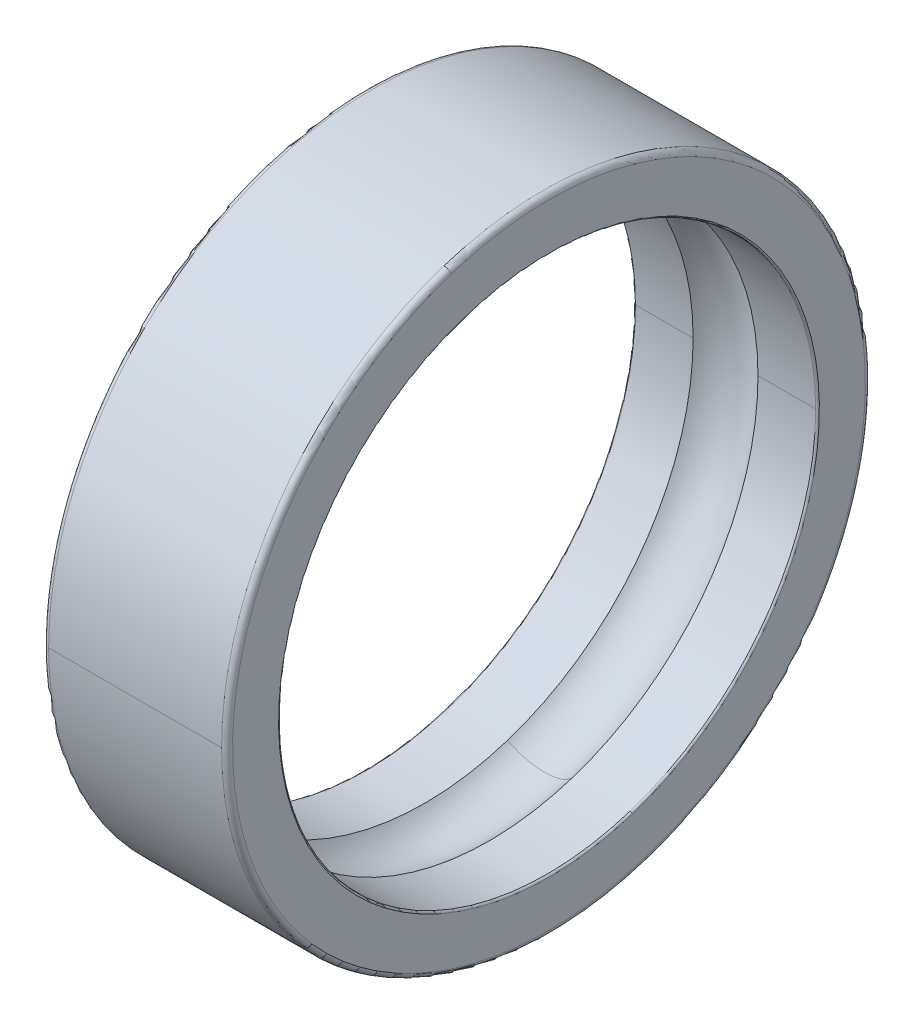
ISO-10303-21;
HEADER;
FILE_DESCRIPTION(('STEP AP214'),'2;1');
FILE_NAME('part.step','',(''),(''),'','','');
FILE_SCHEMA(('AUTOMOTIVE_DESIGN { 1 0 10303 214 1 1 1 1 }'));
ENDSEC;
DATA;
#1=APPLICATION_CONTEXT('core data for automotive mechanical design processes');
#2=APPLICATION_PROTOCOL_DEFINITION('international standard','automotive_design',2000,#1);
#3=PRODUCT_CONTEXT('',#1,'mechanical');
#4=PRODUCT('Part','Part','',(#3));
#5=PRODUCT_RELATED_PRODUCT_CATEGORY('part','',(#4));
#6=PRODUCT_DEFINITION_FORMATION('','',#4);
#7=PRODUCT_DEFINITION_CONTEXT('part definition',#1,'design');
#8=PRODUCT_DEFINITION('design','',#6,#7);
#9=PRODUCT_DEFINITION_SHAPE('','',#8);
#10=(LENGTH_UNIT() NAMED_UNIT(*) SI_UNIT(.MILLI.,.METRE.));
#11=(NAMED_UNIT(*) PLANE_ANGLE_UNIT() SI_UNIT($,.RADIAN.));
#12=(NAMED_UNIT(*) SI_UNIT($,.STERADIAN.) SOLID_ANGLE_UNIT());
#13=UNCERTAINTY_MEASURE_WITH_UNIT(LENGTH_MEASURE(1.E-05),#10,'distance_accuracy_value','');
#14=(GEOMETRIC_REPRESENTATION_CONTEXT(3) GLOBAL_UNCERTAINTY_ASSIGNED_CONTEXT((#13)) GLOBAL_UNIT_ASSIGNED_CONTEXT((#10,
#11,#12)) REPRESENTATION_CONTEXT('',''));
#15=CARTESIAN_POINT('',(0.,0.,0.));
#16=DIRECTION('',(0.,0.,1.));
#17=DIRECTION('',(1.,0.,0.));
#18=AXIS2_PLACEMENT_3D('',#15,#16,#17);
#19=CARTESIAN_POINT('',(0.299999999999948,0.,0.));
#20=DIRECTION('',(1.,0.,0.));
#21=DIRECTION('',(0.,-0.309016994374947,0.951056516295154));
#22=AXIS2_PLACEMENT_3D('',#19,#20,#21);
#23=TOROIDAL_SURFACE('',#22,17.2,0.29999999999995);
#24=CARTESIAN_POINT('',(0.299999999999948,-16.3581720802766,-5.31509230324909));
#25=DIRECTION('',(0.,0.309016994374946,-0.951056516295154));
#26=DIRECTION('',(1.70789308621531E-13,-0.951056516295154,-0.309016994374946));
#27=AXIS2_PLACEMENT_3D('',#24,#25,#26);
#28=CIRCLE('',#27,0.299999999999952);
#29=CARTESIAN_POINT('',(0.3,-16.6434890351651,-5.40779740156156));
#30=VERTEX_POINT('',#29);
#31=CARTESIAN_POINT('',(0.,-16.3581720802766,-5.31509230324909));
#32=VERTEX_POINT('',#31);
#33=EDGE_CURVE('E11',#30,#32,#28,.T.);
#34=ORIENTED_EDGE('',*,*,#33,.T.);
#35=CARTESIAN_POINT('',(0.,-16.3581720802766,-5.31509230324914));
#36=CARTESIAN_POINT('',(0.,-16.271209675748,-5.58275438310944));
#37=CARTESIAN_POINT('',(0.,-16.1776669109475,-5.84827784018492));
#38=CARTESIAN_POINT('',(0.,-15.9776705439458,-6.37441716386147));
#39=CARTESIAN_POINT('',(0.,-15.8712169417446,-6.63503303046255));
#40=CARTESIAN_POINT('',(0.,-15.6456487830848,-7.15072682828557));
#41=CARTESIAN_POINT('',(0.,-15.5265342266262,-7.4058047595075));
#42=CARTESIAN_POINT('',(0.,-15.2759328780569,-7.90980885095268));
#43=CARTESIAN_POINT('',(0.,-15.1444460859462,-8.15873501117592));
#44=CARTESIAN_POINT('',(0.,-14.869416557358,-8.6498356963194));
#45=CARTESIAN_POINT('',(0.,-14.7258738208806,-8.89201022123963));
#46=CARTESIAN_POINT('',(0.,-14.427078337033,-9.36902426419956));
#47=CARTESIAN_POINT('',(0.,-14.2718255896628,-9.60386378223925));
#48=CARTESIAN_POINT('',(0.,-13.9499840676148,-10.0656420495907));
#49=CARTESIAN_POINT('',(0.,-13.7833952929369,-10.2925807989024));
#50=CARTESIAN_POINT('',(0.,-13.4392830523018,-10.7380108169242));
#51=CARTESIAN_POINT('',(0.,-13.2617595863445,-10.9565020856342));
#52=CARTESIAN_POINT('',(0.,-12.8962056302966,-11.3845107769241));
#53=CARTESIAN_POINT('',(0.,-12.7081751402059,-11.594028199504));
#54=CARTESIAN_POINT('',(0.,-12.3220601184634,-12.0035844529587));
#55=CARTESIAN_POINT('',(0.,-12.1239755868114,-12.2036232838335));
#56=CARTESIAN_POINT('',(0.,-11.7182296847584,-12.5937404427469));
#57=CARTESIAN_POINT('',(0.,-11.5105683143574,-12.7838187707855));
#58=CARTESIAN_POINT('',(0.,-11.0861690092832,-13.1535570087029));
#59=CARTESIAN_POINT('',(0.,-10.8694310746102,-13.3332169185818));
#60=CARTESIAN_POINT('',(0.,-10.4274007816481,-13.6816855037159));
#61=CARTESIAN_POINT('',(0.,-10.2021084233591,-13.8504941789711));
#62=CARTESIAN_POINT('',(0.,-9.74351203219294,-14.1768536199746));
#63=CARTESIAN_POINT('',(0.,-9.51020799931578,-14.3344043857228));
#64=CARTESIAN_POINT('',(0.,-9.0361503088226,-14.6378684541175));
#65=CARTESIAN_POINT('',(0.,-8.79539665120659,-14.7837817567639));
#66=CARTESIAN_POINT('',(0.,-8.30701970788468,-15.0636193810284));
#67=CARTESIAN_POINT('',(0.,-8.0593964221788,-15.1975437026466));
#68=CARTESIAN_POINT('',(0.,-7.55787676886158,-15.4530807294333));
#69=CARTESIAN_POINT('',(0.,-7.30398040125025,-15.5746934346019));
#70=CARTESIAN_POINT('',(0.,-6.79052624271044,-15.805314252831));
#71=CARTESIAN_POINT('',(0.,-6.53096845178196,-15.9143223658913));
#72=CARTESIAN_POINT('',(0.,-6.00681674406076,-16.1194713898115));
#73=CARTESIAN_POINT('',(0.,-5.74222282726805,-16.2156123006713));
#74=CARTESIAN_POINT('',(0.,-5.20863629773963,-16.3947953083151));
#75=CARTESIAN_POINT('',(0.,-4.93964368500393,-16.477837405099));
#76=CARTESIAN_POINT('',(0.,-4.3979077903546,-16.6306227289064));
#77=CARTESIAN_POINT('',(0.,-4.12516450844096,-16.7003659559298));
#78=CARTESIAN_POINT('',(0.,-3.57658433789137,-16.8263855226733));
#79=CARTESIAN_POINT('',(0.,-3.30074744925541,-16.8826618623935));
#80=CARTESIAN_POINT('',(0.,-2.74664458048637,-16.9816120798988));
#81=CARTESIAN_POINT('',(0.,-2.46837860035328,-17.0242859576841));
#82=CARTESIAN_POINT('',(0.,-1.91008791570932,-17.0959284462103));
#83=CARTESIAN_POINT('',(0.,-1.63006321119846,-17.1248970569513));
#84=CARTESIAN_POINT('',(0.,-1.06892968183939,-17.1690592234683));
#85=CARTESIAN_POINT('',(0.,-0.787820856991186,-17.1842527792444));
#86=CARTESIAN_POINT('',(0.,-0.225196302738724,-17.2008282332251));
#87=CARTESIAN_POINT('',(0.,0.0563194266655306,-17.2022101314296));
#88=CARTESIAN_POINT('',(0.,0.619079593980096,-17.1911589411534));
#89=CARTESIAN_POINT('',(0.,0.900324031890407,-17.1787258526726));
#90=CARTESIAN_POINT('',(0.,1.46186407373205,-17.1400746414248));
#91=CARTESIAN_POINT('',(0.,1.74215967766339,-17.1138565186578));
#92=CARTESIAN_POINT('',(0.,2.30112679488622,-17.0476984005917));
#93=CARTESIAN_POINT('',(0.,2.57979830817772,-17.0077584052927));
#94=CARTESIAN_POINT('',(0.,3.13484590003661,-16.9142527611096));
#95=CARTESIAN_POINT('',(0.,3.41122197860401,-16.8606871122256));
#96=CARTESIAN_POINT('',(0.,3.96101288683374,-16.7400592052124));
#97=CARTESIAN_POINT('',(0.,4.23442771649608,-16.6729969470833));
#98=CARTESIAN_POINT('',(0.,4.77763744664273,-16.5255373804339));
#99=CARTESIAN_POINT('',(0.,5.04743234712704,-16.4451400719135));
#100=CARTESIAN_POINT('',(0.,5.58275225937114,-16.2712040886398));
#101=CARTESIAN_POINT('',(0.,5.84827727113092,-16.1776654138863));
#102=CARTESIAN_POINT('',(0.,6.37441773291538,-15.9776720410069));
#103=CARTESIAN_POINT('',(0.,6.63503318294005,-15.8712173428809));
#104=CARTESIAN_POINT('',(0.,7.15072667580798,-15.6456483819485));
#105=CARTESIAN_POINT('',(0.,7.40580471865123,-15.5265341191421));
#106=CARTESIAN_POINT('',(0.,7.90980889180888,-15.2759329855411));
#107=CARTESIAN_POINT('',(0.,8.15873502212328,-15.1444461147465));
#108=CARTESIAN_POINT('',(0.,8.64983568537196,-14.8694165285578));
#109=CARTESIAN_POINT('',(0.,8.89201021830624,-14.7258738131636));
#110=CARTESIAN_POINT('',(0.,9.36902426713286,-14.4270783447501));
#111=CARTESIAN_POINT('',(0.,9.6038637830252,-14.2718255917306));
#112=CARTESIAN_POINT('',(0.,10.0656420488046,-13.949984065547));
#113=CARTESIAN_POINT('',(0.,10.2925807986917,-13.7833952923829));
#114=CARTESIAN_POINT('',(0.,10.7380108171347,-13.4392830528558));
#115=CARTESIAN_POINT('',(0.,10.9565020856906,-13.2617595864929));
#116=CARTESIAN_POINT('',(0.,11.3845107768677,-12.8962056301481));
#117=CARTESIAN_POINT('',(0.,11.5940281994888,-12.7081751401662));
#118=CARTESIAN_POINT('',(0.,12.0035844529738,-12.3220601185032));
#119=CARTESIAN_POINT('',(0.,12.2036232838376,-12.1239755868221));
#120=CARTESIAN_POINT('',(0.,12.5937404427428,-11.7182296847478));
#121=CARTESIAN_POINT('',(0.,12.7838187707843,-11.5105683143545));
#122=CARTESIAN_POINT('',(0.,13.1535570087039,-11.0861690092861));
#123=CARTESIAN_POINT('',(0.,13.333216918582,-10.869431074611));
#124=CARTESIAN_POINT('',(0.,13.6816855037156,-10.4274007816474));
#125=CARTESIAN_POINT('',(0.,13.850494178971,-10.2021084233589));
#126=CARTESIAN_POINT('',(0.,14.1768536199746,-9.74351203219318));
#127=CARTESIAN_POINT('',(0.,14.3344043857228,-9.51020799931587));
#128=CARTESIAN_POINT('',(0.,14.6378684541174,-9.03615030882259));
#129=CARTESIAN_POINT('',(0.,14.7837817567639,-8.79539665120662));
#130=CARTESIAN_POINT('',(0.,15.0636193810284,-8.30701970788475));
#131=CARTESIAN_POINT('',(0.,15.1975437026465,-8.05939642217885));
#132=CARTESIAN_POINT('',(0.,15.4530807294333,-7.55787676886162));
#133=CARTESIAN_POINT('',(0.,15.5746934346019,-7.30398040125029));
#134=CARTESIAN_POINT('',(0.,15.805314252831,-6.79052624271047));
#135=CARTESIAN_POINT('',(0.,15.9143223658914,-6.53096845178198));
#136=CARTESIAN_POINT('',(0.,16.1194713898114,-6.00681674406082));
#137=CARTESIAN_POINT('',(0.,16.2156123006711,-5.74222282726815));
#138=CARTESIAN_POINT('',(0.,16.3947953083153,-5.20863629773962));
#139=CARTESIAN_POINT('',(0.,16.4778374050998,-4.93964368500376));
#140=CARTESIAN_POINT('',(0.,16.6306227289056,-4.39790779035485));
#141=CARTESIAN_POINT('',(0.,16.7003659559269,-4.1251645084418));
#142=CARTESIAN_POINT('',(0.,16.8263855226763,-3.57658433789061));
#143=CARTESIAN_POINT('',(0.,16.8826618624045,-3.30074744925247));
#144=CARTESIAN_POINT('',(0.,16.9816120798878,-2.7466445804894));
#145=CARTESIAN_POINT('',(0.,17.024285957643,-2.46837860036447));
#146=CARTESIAN_POINT('',(0.,17.0959284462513,-1.91008791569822));
#147=CARTESIAN_POINT('',(0.,17.1248970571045,-1.6300632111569));
#148=CARTESIAN_POINT('',(0.,17.1690592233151,-1.06892968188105));
#149=CARTESIAN_POINT('',(0.,17.1842527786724,-0.787820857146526));
#150=CARTESIAN_POINT('',(0.,17.2008282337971,-0.2251963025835));
#151=CARTESIAN_POINT('',(0.,17.2022101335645,0.0563194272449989));
#152=CARTESIAN_POINT('',(0.,17.1911589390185,0.619079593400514));
#153=CARTESIAN_POINT('',(0.,17.1787258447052,0.900324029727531));
#154=CARTESIAN_POINT('',(0.,17.1400746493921,1.46186407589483));
#155=CARTESIAN_POINT('',(0.,17.1138565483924,1.74215968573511));
#156=CARTESIAN_POINT('',(0.,17.0476983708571,2.30112678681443));
#157=CARTESIAN_POINT('',(0.,17.0077582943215,2.57979827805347));
#158=CARTESIAN_POINT('',(0.,16.9142528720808,3.13484593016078));
#159=CARTESIAN_POINT('',(0.,16.8606875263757,3.41122209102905));
#160=CARTESIAN_POINT('',(0.,16.7400587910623,3.9610127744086));
#161=CARTESIAN_POINT('',(0.,16.6729954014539,4.23442729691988));
#162=CARTESIAN_POINT('',(0.,16.5255389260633,4.77763786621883));
#163=CARTESIAN_POINT('',(0.,16.4451458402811,5.0474339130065));
#164=CARTESIAN_POINT('',(0.,16.3581720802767,5.31509230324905));
#165=B_SPLINE_CURVE_WITH_KNOTS('',3,(#35,#36,#37,#38,#39,#40,#41,#42,#43,#44,#45,#46,#47,#48,
#49,#50,#51,#52,#53,#54,#55,#56,#57,#58,#59,#60,#61,#62,#63,#64,#65,#66,#67,#68,#69,#70,#71,#72,
#73,#74,#75,#76,#77,#78,#79,#80,#81,#82,#83,#84,#85,#86,#87,#88,#89,#90,#91,#92,#93,#94,#95,#96,
#97,#98,#99,#100,#101,#102,#103,#104,#105,#106,#107,#108,#109,#110,#111,#112,#113,#114,#115,
#116,#117,#118,#119,#120,#121,#122,#123,#124,#125,#126,#127,#128,#129,#130,#131,#132,#133,#134,
#135,#136,#137,#138,#139,#140,#141,#142,#143,#144,#145,#146,#147,#148,#149,#150,#151,#152,#153,
#154,#155,#156,#157,#158,#159,#160,#161,#162,#163,#164),.UNSPECIFIED.,.F.,.F.,(4,2,2,2,2,2,2,2,
2,2,2,2,2,2,2,2,2,2,2,2,2,2,2,2,2,2,2,2,2,2,2,2,2,2,2,2,2,2,2,2,2,2,2,2,2,2,2,2,2,2,2,2,2,2,2,2,
2,2,2,2,2,2,2,2,4),(0.,0.84421826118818,1.68843652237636,2.53265478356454,3.37687304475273,
4.22109130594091,5.06530956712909,5.90952782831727,6.75374608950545,7.59796435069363,
8.44218261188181,9.28640087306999,10.1306191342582,10.9748373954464,11.8190556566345,
12.6632739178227,13.5074921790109,14.3517104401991,15.1959287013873,16.0401469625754,
16.8843652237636,17.7285834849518,18.57280174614,19.4170200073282,20.2612382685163,
21.1054565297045,21.9496747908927,22.7938930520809,23.6381113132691,24.4823295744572,
25.3265478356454,26.1707660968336,27.0149843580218,27.85920261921,28.7034208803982,
29.5476391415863,30.3918574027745,31.2360756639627,32.0802939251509,32.9245121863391,
33.7687304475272,34.6129487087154,35.4571669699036,36.3013852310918,37.14560349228,
37.9898217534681,38.8340400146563,39.6782582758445,40.5224765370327,41.3666947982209,
42.2109130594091,43.0551313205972,43.8993495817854,44.7435678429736,45.5877861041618,
46.43200436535,47.2762226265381,48.1204408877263,48.9646591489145,49.8088774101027,
50.6530956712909,51.4973139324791,52.3415321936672,53.1857504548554,54.0299687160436),.UNSPECIFIED.);
#166=CARTESIAN_POINT('',(0.,16.3581720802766,5.31509230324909));
#167=VERTEX_POINT('',#166);
#168=EDGE_CURVE('E26',#32,#167,#165,.T.);
#169=ORIENTED_EDGE('',*,*,#168,.T.);
#170=CARTESIAN_POINT('',(0.299999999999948,16.3581720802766,5.31509230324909));
#171=DIRECTION('',(0.,-0.309016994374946,0.951056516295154));
#172=DIRECTION('',(1.72639680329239E-13,0.951056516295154,0.309016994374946));
#173=AXIS2_PLACEMENT_3D('',#170,#171,#172);
#174=CIRCLE('',#173,0.299999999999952);
#175=CARTESIAN_POINT('',(0.3,16.6434890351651,5.40779740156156));
#176=VERTEX_POINT('',#175);
#177=EDGE_CURVE('E307',#176,#167,#174,.T.);
#178=ORIENTED_EDGE('',*,*,#177,.F.);
#179=CARTESIAN_POINT('',(0.3,0.,0.));
#180=DIRECTION('',(1.,0.,0.));
#181=DIRECTION('',(0.,0.,-1.));
#182=AXIS2_PLACEMENT_3D('',#179,#180,#181);
#183=CIRCLE('',#182,17.5);
#184=CARTESIAN_POINT('',(0.3,0.,-17.5));
#185=VERTEX_POINT('',#184);
#186=EDGE_CURVE('E308',#185,#176,#183,.T.);
#187=ORIENTED_EDGE('',*,*,#186,.F.);
#188=CARTESIAN_POINT('',(0.3,0.,0.));
#189=DIRECTION('',(1.,0.,0.));
#190=DIRECTION('',(0.,0.,-1.));
#191=AXIS2_PLACEMENT_3D('',#188,#189,#190);
#192=CIRCLE('',#191,17.5);
#193=EDGE_CURVE('E313',#30,#185,#192,.T.);
#194=ORIENTED_EDGE('',*,*,#193,.F.);
#195=EDGE_LOOP('',(#34,#169,#178,#187,#194));
#196=FACE_BOUND('',#195,.T.);
#197=ADVANCED_FACE('F17',(#196),#23,.T.);
#198=CARTESIAN_POINT('',(50.,0.,0.));
#199=DIRECTION('',(1.,0.,0.));
#200=DIRECTION('',(0.,1.,0.));
#201=AXIS2_PLACEMENT_3D('',#198,#199,#200);
#202=CYLINDRICAL_SURFACE('',#201,17.5);
#203=DIRECTION('',(1.,0.,0.));
#204=VECTOR('',#203,1.);
#205=CARTESIAN_POINT('',(0.299999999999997,0.,17.5));
#206=LINE('',#205,#204);
#207=CARTESIAN_POINT('',(0.299999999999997,0.,17.5));
#208=VERTEX_POINT('',#207);
#209=CARTESIAN_POINT('',(9.7,0.,17.5));
#210=VERTEX_POINT('',#209);
#211=EDGE_CURVE('E332',#208,#210,#206,.T.);
#212=ORIENTED_EDGE('',*,*,#211,.F.);
#213=CARTESIAN_POINT('',(0.3,0.,0.));
#214=DIRECTION('',(1.,0.,0.));
#215=DIRECTION('',(0.,0.,-1.));
#216=AXIS2_PLACEMENT_3D('',#213,#214,#215);
#217=CIRCLE('',#216,17.5);
#218=EDGE_CURVE('E337',#208,#30,#217,.T.);
#219=ORIENTED_EDGE('',*,*,#218,.T.);
#220=ORIENTED_EDGE('',*,*,#193,.T.);
#221=DIRECTION('',(1.,0.,0.));
#222=VECTOR('',#221,1.);
#223=CARTESIAN_POINT('',(0.299999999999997,0.,-17.5));
#224=LINE('',#223,#222);
#225=CARTESIAN_POINT('',(9.7,0.,-17.5));
#226=VERTEX_POINT('',#225);
#227=EDGE_CURVE('E342',#185,#226,#224,.T.);
#228=ORIENTED_EDGE('',*,*,#227,.T.);
#229=CARTESIAN_POINT('',(9.7,0.,0.));
#230=DIRECTION('',(1.,0.,0.));
#231=DIRECTION('',(0.,0.,-1.));
#232=AXIS2_PLACEMENT_3D('',#229,#230,#231);
#233=CIRCLE('',#232,17.5);
#234=CARTESIAN_POINT('',(9.7,-16.6434890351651,-5.40779740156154));
#235=VERTEX_POINT('',#234);
#236=EDGE_CURVE('E346',#235,#226,#233,.T.);
#237=ORIENTED_EDGE('',*,*,#236,.F.);
#238=CARTESIAN_POINT('',(9.7,0.,0.));
#239=DIRECTION('',(1.,0.,0.));
#240=DIRECTION('',(0.,0.,-1.));
#241=AXIS2_PLACEMENT_3D('',#238,#239,#240);
#242=CIRCLE('',#241,17.5);
#243=EDGE_CURVE('E351',#210,#235,#242,.T.);
#244=ORIENTED_EDGE('',*,*,#243,.F.);
#245=EDGE_LOOP('',(#212,#219,#220,#228,#237,#244));
#246=FACE_BOUND('',#245,.T.);
#247=ADVANCED_FACE('F452',(#246),#202,.T.);
#248=CARTESIAN_POINT('',(9.70000000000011,0.,0.));
#249=DIRECTION('',(1.,0.,0.));
#250=DIRECTION('',(0.,0.309016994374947,-0.951056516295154));
#251=AXIS2_PLACEMENT_3D('',#248,#249,#250);
#252=TOROIDAL_SURFACE('',#251,17.2,0.299999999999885);
#253=CARTESIAN_POINT('',(9.70000000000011,-16.3581720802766,-5.31509230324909));
#254=DIRECTION('',(0.,0.309016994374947,-0.951056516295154));
#255=DIRECTION('',(1.,0.,0.));
#256=AXIS2_PLACEMENT_3D('',#253,#254,#255);
#257=CIRCLE('',#256,0.299999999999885);
#258=CARTESIAN_POINT('',(9.99999999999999,-16.3581720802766,-5.31509230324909));
#259=VERTEX_POINT('',#258);
#260=EDGE_CURVE('E356',#259,#235,#257,.T.);
#261=ORIENTED_EDGE('',*,*,#260,.F.);
#262=CARTESIAN_POINT('',(10.,0.,0.));
#263=DIRECTION('',(1.,0.,0.));
#264=DIRECTION('',(0.,0.,-1.));
#265=AXIS2_PLACEMENT_3D('',#262,#263,#264);
#266=CIRCLE('',#265,17.2);
#267=CARTESIAN_POINT('',(9.99999999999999,16.3581720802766,5.31509230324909));
#268=VERTEX_POINT('',#267);
#269=EDGE_CURVE('E361',#268,#259,#266,.T.);
#270=ORIENTED_EDGE('',*,*,#269,.F.);
#271=CARTESIAN_POINT('',(9.70000000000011,16.3581720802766,5.31509230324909));
#272=DIRECTION('',(0.,-0.309016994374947,0.951056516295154));
#273=DIRECTION('',(1.,0.,0.));
#274=AXIS2_PLACEMENT_3D('',#271,#272,#273);
#275=CIRCLE('',#274,0.299999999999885);
#276=CARTESIAN_POINT('',(9.7,16.6434890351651,5.40779740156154));
#277=VERTEX_POINT('',#276);
#278=EDGE_CURVE('E366',#268,#277,#275,.T.);
#279=ORIENTED_EDGE('',*,*,#278,.T.);
#280=CARTESIAN_POINT('',(9.7,0.,0.));
#281=DIRECTION('',(1.,0.,0.));
#282=DIRECTION('',(0.,0.,-1.));
#283=AXIS2_PLACEMENT_3D('',#280,#281,#282);
#284=CIRCLE('',#283,17.5);
#285=EDGE_CURVE('E370',#277,#210,#284,.T.);
#286=ORIENTED_EDGE('',*,*,#285,.T.);
#287=ORIENTED_EDGE('',*,*,#243,.T.);
#288=EDGE_LOOP('',(#261,#270,#279,#286,#287));
#289=FACE_BOUND('',#288,.T.);
#290=ADVANCED_FACE('F456',(#289),#252,.T.);
#291=CARTESIAN_POINT('',(50.,0.,0.));
#292=DIRECTION('',(1.,0.,0.));
#293=DIRECTION('',(0.,-1.,0.));
#294=AXIS2_PLACEMENT_3D('',#291,#292,#293);
#295=CYLINDRICAL_SURFACE('',#294,17.5);
#296=ORIENTED_EDGE('',*,*,#211,.T.);
#297=ORIENTED_EDGE('',*,*,#285,.F.);
#298=CARTESIAN_POINT('',(9.7,0.,0.));
#299=DIRECTION('',(1.,0.,0.));
#300=DIRECTION('',(0.,0.,-1.));
#301=AXIS2_PLACEMENT_3D('',#298,#299,#300);
#302=CIRCLE('',#301,17.5);
#303=EDGE_CURVE('E375',#226,#277,#302,.T.);
#304=ORIENTED_EDGE('',*,*,#303,.F.);
#305=ORIENTED_EDGE('',*,*,#227,.F.);
#306=ORIENTED_EDGE('',*,*,#186,.T.);
#307=CARTESIAN_POINT('',(0.3,0.,0.));
#308=DIRECTION('',(1.,0.,0.));
#309=DIRECTION('',(0.,0.,-1.));
#310=AXIS2_PLACEMENT_3D('',#307,#308,#309);
#311=CIRCLE('',#310,17.5);
#312=EDGE_CURVE('E380',#176,#208,#311,.T.);
#313=ORIENTED_EDGE('',*,*,#312,.T.);
#314=EDGE_LOOP('',(#296,#297,#304,#305,#306,#313));
#315=FACE_BOUND('',#314,.T.);
#316=ADVANCED_FACE('F461',(#315),#295,.T.);
#317=CARTESIAN_POINT('',(0.299999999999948,0.,0.));
#318=DIRECTION('',(1.,0.,0.));
#319=DIRECTION('',(0.,0.309016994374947,-0.951056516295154));
#320=AXIS2_PLACEMENT_3D('',#317,#318,#319);
#321=TOROIDAL_SURFACE('',#320,17.2,0.29999999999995);
#322=ORIENTED_EDGE('',*,*,#33,.F.);
#323=ORIENTED_EDGE('',*,*,#218,.F.);
#324=ORIENTED_EDGE('',*,*,#312,.F.);
#325=ORIENTED_EDGE('',*,*,#177,.T.);
#326=CARTESIAN_POINT('',(0.,16.3581720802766,5.31509230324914));
#327=CARTESIAN_POINT('',(0.,16.271209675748,5.58275438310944));
#328=CARTESIAN_POINT('',(0.,16.1776669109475,5.84827784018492));
#329=CARTESIAN_POINT('',(0.,15.9776705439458,6.37441716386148));
#330=CARTESIAN_POINT('',(0.,15.8712169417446,6.63503303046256));
#331=CARTESIAN_POINT('',(0.,15.6456487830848,7.15072682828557));
#332=CARTESIAN_POINT('',(0.,15.5265342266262,7.4058047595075));
#333=CARTESIAN_POINT('',(0.,15.2759328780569,7.90980885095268));
#334=CARTESIAN_POINT('',(0.,15.1444460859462,8.15873501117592));
#335=CARTESIAN_POINT('',(0.,14.869416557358,8.6498356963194));
#336=CARTESIAN_POINT('',(0.,14.7258738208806,8.89201022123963));
#337=CARTESIAN_POINT('',(0.,14.427078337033,9.36902426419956));
#338=CARTESIAN_POINT('',(0.,14.2718255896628,9.60386378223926));
#339=CARTESIAN_POINT('',(0.,13.9499840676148,10.0656420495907));
#340=CARTESIAN_POINT('',(0.,13.7833952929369,10.2925807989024));
#341=CARTESIAN_POINT('',(0.,13.4392830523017,10.7380108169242));
#342=CARTESIAN_POINT('',(0.,13.2617595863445,10.9565020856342));
#343=CARTESIAN_POINT('',(0.,12.8962056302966,11.3845107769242));
#344=CARTESIAN_POINT('',(0.,12.7081751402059,11.594028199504));
#345=CARTESIAN_POINT('',(0.,12.3220601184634,12.0035844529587));
#346=CARTESIAN_POINT('',(0.,12.1239755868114,12.2036232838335));
#347=CARTESIAN_POINT('',(0.,11.7182296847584,12.5937404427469));
#348=CARTESIAN_POINT('',(0.,11.5105683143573,12.7838187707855));
#349=CARTESIAN_POINT('',(0.,11.0861690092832,13.1535570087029));
#350=CARTESIAN_POINT('',(0.,10.8694310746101,13.3332169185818));
#351=CARTESIAN_POINT('',(0.,10.4274007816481,13.6816855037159));
#352=CARTESIAN_POINT('',(0.,10.2021084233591,13.8504941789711));
#353=CARTESIAN_POINT('',(0.,9.74351203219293,14.1768536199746));
#354=CARTESIAN_POINT('',(0.,9.51020799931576,14.3344043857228));
#355=CARTESIAN_POINT('',(0.,9.03615030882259,14.6378684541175));
#356=CARTESIAN_POINT('',(0.,8.79539665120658,14.7837817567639));
#357=CARTESIAN_POINT('',(0.,8.30701970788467,15.0636193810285));
#358=CARTESIAN_POINT('',(0.,8.05939642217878,15.1975437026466));
#359=CARTESIAN_POINT('',(0.,7.55787676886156,15.4530807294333));
#360=CARTESIAN_POINT('',(0.,7.30398040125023,15.574693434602));
#361=CARTESIAN_POINT('',(0.,6.79052624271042,15.805314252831));
#362=CARTESIAN_POINT('',(0.,6.53096845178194,15.9143223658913));
#363=CARTESIAN_POINT('',(0.,6.00681674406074,16.1194713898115));
#364=CARTESIAN_POINT('',(0.,5.74222282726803,16.2156123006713));
#365=CARTESIAN_POINT('',(0.,5.20863629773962,16.3947953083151));
#366=CARTESIAN_POINT('',(0.,4.93964368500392,16.4778374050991));
#367=CARTESIAN_POINT('',(0.,4.39790779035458,16.6306227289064));
#368=CARTESIAN_POINT('',(0.,4.12516450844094,16.7003659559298));
#369=CARTESIAN_POINT('',(0.,3.57658433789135,16.8263855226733));
#370=CARTESIAN_POINT('',(0.,3.30074744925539,16.8826618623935));
#371=CARTESIAN_POINT('',(0.,2.74664458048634,16.9816120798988));
#372=CARTESIAN_POINT('',(0.,2.46837860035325,17.0242859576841));
#373=CARTESIAN_POINT('',(0.,1.9100879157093,17.0959284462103));
#374=CARTESIAN_POINT('',(0.,1.63006321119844,17.1248970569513));
#375=CARTESIAN_POINT('',(0.,1.06892968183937,17.1690592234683));
#376=CARTESIAN_POINT('',(0.,0.787820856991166,17.1842527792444));
#377=CARTESIAN_POINT('',(0.,0.225196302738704,17.2008282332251));
#378=CARTESIAN_POINT('',(0.,-0.0563194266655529,17.2022101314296));
#379=CARTESIAN_POINT('',(0.,-0.619079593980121,17.1911589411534));
#380=CARTESIAN_POINT('',(0.,-0.900324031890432,17.1787258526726));
#381=CARTESIAN_POINT('',(0.,-1.46186407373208,17.1400746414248));
#382=CARTESIAN_POINT('',(0.,-1.74215967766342,17.1138565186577));
#383=CARTESIAN_POINT('',(0.,-2.30112679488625,17.0476984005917));
#384=CARTESIAN_POINT('',(0.,-2.57979830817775,17.0077584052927));
#385=CARTESIAN_POINT('',(0.,-3.13484590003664,16.9142527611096));
#386=CARTESIAN_POINT('',(0.,-3.41122197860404,16.8606871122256));
#387=CARTESIAN_POINT('',(0.,-3.96101288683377,16.7400592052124));
#388=CARTESIAN_POINT('',(0.,-4.23442771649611,16.6729969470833));
#389=CARTESIAN_POINT('',(0.,-4.77763744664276,16.5255373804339));
#390=CARTESIAN_POINT('',(0.,-5.04743234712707,16.4451400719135));
#391=CARTESIAN_POINT('',(0.,-5.58275225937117,16.2712040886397));
#392=CARTESIAN_POINT('',(0.,-5.84827727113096,16.1776654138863));
#393=CARTESIAN_POINT('',(0.,-6.37441773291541,15.9776720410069));
#394=CARTESIAN_POINT('',(0.,-6.63503318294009,15.8712173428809));
#395=CARTESIAN_POINT('',(0.,-7.15072667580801,15.6456483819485));
#396=CARTESIAN_POINT('',(0.,-7.40580471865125,15.5265341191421));
#397=CARTESIAN_POINT('',(0.,-7.9098088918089,15.2759329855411));
#398=CARTESIAN_POINT('',(0.,-8.1587350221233,15.1444461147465));
#399=CARTESIAN_POINT('',(0.,-8.64983568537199,14.8694165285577));
#400=CARTESIAN_POINT('',(0.,-8.89201021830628,14.7258738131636));
#401=CARTESIAN_POINT('',(0.,-9.36902426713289,14.42707834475));
#402=CARTESIAN_POINT('',(0.,-9.60386378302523,14.2718255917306));
#403=CARTESIAN_POINT('',(0.,-10.0656420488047,13.949984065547));
#404=CARTESIAN_POINT('',(0.,-10.2925807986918,13.7833952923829));
#405=CARTESIAN_POINT('',(0.,-10.7380108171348,13.4392830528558));
#406=CARTESIAN_POINT('',(0.,-10.9565020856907,13.2617595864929));
#407=CARTESIAN_POINT('',(0.,-11.3845107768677,12.8962056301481));
#408=CARTESIAN_POINT('',(0.,-11.5940281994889,12.7081751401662));
#409=CARTESIAN_POINT('',(0.,-12.0035844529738,12.3220601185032));
#410=CARTESIAN_POINT('',(0.,-12.2036232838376,12.1239755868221));
#411=CARTESIAN_POINT('',(0.,-12.5937404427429,11.7182296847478));
#412=CARTESIAN_POINT('',(0.,-12.7838187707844,11.5105683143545));
#413=CARTESIAN_POINT('',(0.,-13.153557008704,11.0861690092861));
#414=CARTESIAN_POINT('',(0.,-13.3332169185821,10.8694310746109));
#415=CARTESIAN_POINT('',(0.,-13.6816855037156,10.4274007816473));
#416=CARTESIAN_POINT('',(0.,-13.850494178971,10.2021084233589));
#417=CARTESIAN_POINT('',(0.,-14.1768536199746,9.74351203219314));
#418=CARTESIAN_POINT('',(0.,-14.3344043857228,9.51020799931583));
#419=CARTESIAN_POINT('',(0.,-14.6378684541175,9.03615030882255));
#420=CARTESIAN_POINT('',(0.,-14.7837817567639,8.79539665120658));
#421=CARTESIAN_POINT('',(0.,-15.0636193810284,8.30701970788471));
#422=CARTESIAN_POINT('',(0.,-15.1975437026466,8.05939642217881));
#423=CARTESIAN_POINT('',(0.,-15.4530807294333,7.55787676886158));
#424=CARTESIAN_POINT('',(0.,-15.5746934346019,7.30398040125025));
#425=CARTESIAN_POINT('',(0.,-15.805314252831,6.79052624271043));
#426=CARTESIAN_POINT('',(0.,-15.9143223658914,6.53096845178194));
#427=CARTESIAN_POINT('',(0.,-16.1194713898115,6.00681674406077));
#428=CARTESIAN_POINT('',(0.,-16.2156123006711,5.7422228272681));
#429=CARTESIAN_POINT('',(0.,-16.3947953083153,5.20863629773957));
#430=CARTESIAN_POINT('',(0.,-16.4778374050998,4.93964368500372));
#431=CARTESIAN_POINT('',(0.,-16.6306227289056,4.39790779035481));
#432=CARTESIAN_POINT('',(0.,-16.7003659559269,4.12516450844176));
#433=CARTESIAN_POINT('',(0.,-16.8263855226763,3.57658433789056));
#434=CARTESIAN_POINT('',(0.,-16.8826618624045,3.30074744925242));
#435=CARTESIAN_POINT('',(0.,-16.9816120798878,2.74664458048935));
#436=CARTESIAN_POINT('',(0.,-17.024285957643,2.46837860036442));
#437=CARTESIAN_POINT('',(0.,-17.0959284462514,1.91008791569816));
#438=CARTESIAN_POINT('',(0.,-17.1248970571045,1.63006321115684));
#439=CARTESIAN_POINT('',(0.,-17.1690592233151,1.06892968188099));
#440=CARTESIAN_POINT('',(0.,-17.1842527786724,0.787820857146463));
#441=CARTESIAN_POINT('',(0.,-17.2008282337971,0.225196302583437));
#442=CARTESIAN_POINT('',(0.,-17.2022101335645,-0.0563194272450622));
#443=CARTESIAN_POINT('',(0.,-17.1911589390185,-0.619079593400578));
#444=CARTESIAN_POINT('',(0.,-17.1787258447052,-0.900324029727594));
#445=CARTESIAN_POINT('',(0.,-17.1400746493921,-1.46186407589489));
#446=CARTESIAN_POINT('',(0.,-17.1138565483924,-1.74215968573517));
#447=CARTESIAN_POINT('',(0.,-17.0476983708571,-2.30112678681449));
#448=CARTESIAN_POINT('',(0.,-17.0077582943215,-2.57979827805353));
#449=CARTESIAN_POINT('',(0.,-16.9142528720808,-3.13484593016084));
#450=CARTESIAN_POINT('',(0.,-16.8606875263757,-3.41122209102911));
#451=CARTESIAN_POINT('',(0.,-16.7400587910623,-3.96101277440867));
#452=CARTESIAN_POINT('',(0.,-16.6729954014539,-4.23442729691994));
#453=CARTESIAN_POINT('',(0.,-16.5255389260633,-4.77763786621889));
#454=CARTESIAN_POINT('',(0.,-16.4451458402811,-5.04743391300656));
#455=CARTESIAN_POINT('',(0.,-16.3581720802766,-5.31509230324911));
#456=B_SPLINE_CURVE_WITH_KNOTS('',3,(#326,#327,#328,#329,#330,#331,#332,#333,#334,#335,#336,
#337,#338,#339,#340,#341,#342,#343,#344,#345,#346,#347,#348,#349,#350,#351,#352,#353,#354,#355,
#356,#357,#358,#359,#360,#361,#362,#363,#364,#365,#366,#367,#368,#369,#370,#371,#372,#373,#374,
#375,#376,#377,#378,#379,#380,#381,#382,#383,#384,#385,#386,#387,#388,#389,#390,#391,#392,#393,
#394,#395,#396,#397,#398,#399,#400,#401,#402,#403,#404,#405,#406,#407,#408,#409,#410,#411,#412,
#413,#414,#415,#416,#417,#418,#419,#420,#421,#422,#423,#424,#425,#426,#427,#428,#429,#430,#431,
#432,#433,#434,#435,#436,#437,#438,#439,#440,#441,#442,#443,#444,#445,#446,#447,#448,#449,#450,
#451,#452,#453,#454,#455),.UNSPECIFIED.,.F.,.F.,(4,2,2,2,2,2,2,2,2,2,2,2,2,2,2,2,2,2,2,2,2,2,2,
2,2,2,2,2,2,2,2,2,2,2,2,2,2,2,2,2,2,2,2,2,2,2,2,2,2,2,2,2,2,2,2,2,2,2,2,2,2,2,2,2,4),(0.,
0.84421826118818,1.68843652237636,2.53265478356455,3.37687304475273,4.22109130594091,
5.0653095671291,5.90952782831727,6.75374608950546,7.59796435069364,8.44218261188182,
9.28640087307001,10.1306191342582,10.9748373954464,11.8190556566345,12.6632739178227,
13.5074921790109,14.3517104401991,15.1959287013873,16.0401469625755,16.8843652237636,
17.7285834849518,18.57280174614,19.4170200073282,20.2612382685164,21.1054565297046,
21.9496747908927,22.7938930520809,23.6381113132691,24.4823295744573,25.3265478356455,
26.1707660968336,27.0149843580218,27.85920261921,28.7034208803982,29.5476391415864,
30.3918574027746,31.2360756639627,32.0802939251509,32.9245121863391,33.7687304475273,
34.6129487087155,35.4571669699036,36.3013852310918,37.14560349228,37.9898217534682,
38.8340400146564,39.6782582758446,40.5224765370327,41.3666947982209,42.2109130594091,
43.0551313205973,43.8993495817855,44.7435678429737,45.5877861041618,46.43200436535,
47.2762226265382,48.1204408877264,48.9646591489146,49.8088774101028,50.653095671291,
51.4973139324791,52.3415321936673,53.1857504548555,54.0299687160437),.UNSPECIFIED.);
#457=EDGE_CURVE('E298',#167,#32,#456,.T.);
#458=ORIENTED_EDGE('',*,*,#457,.T.);
#459=EDGE_LOOP('',(#322,#323,#324,#325,#458));
#460=FACE_BOUND('',#459,.T.);
#461=ADVANCED_FACE('F273',(#460),#321,.T.);
#462=CARTESIAN_POINT('',(0.,17.2,0.));
#463=DIRECTION('',(-1.,0.,0.));
#464=DIRECTION('',(0.,0.,1.));
#465=AXIS2_PLACEMENT_3D('',#462,#463,#464);
#466=PLANE('',#465);
#467=CARTESIAN_POINT('',(0.,0.,0.));
#468=DIRECTION('',(1.,0.,0.));
#469=DIRECTION('',(0.,0.,-1.));
#470=AXIS2_PLACEMENT_3D('',#467,#468,#469);
#471=CIRCLE('',#470,14.7);
#472=CARTESIAN_POINT('',(0.,13.9805307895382,4.54254981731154));
#473=VERTEX_POINT('',#472);
#474=CARTESIAN_POINT('',(0.,-13.9805307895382,-4.54254981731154));
#475=VERTEX_POINT('',#474);
#476=EDGE_CURVE('E396',#473,#475,#471,.T.);
#477=ORIENTED_EDGE('',*,*,#476,.T.);
#478=CARTESIAN_POINT('',(0.,-13.9805307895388,-4.54254981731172));
#479=CARTESIAN_POINT('',(0.,-13.2669597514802,-6.73858591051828));
#480=CARTESIAN_POINT('',(0.,-12.1223756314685,-8.79464583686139));
#481=CARTESIAN_POINT('',(0.,-10.5826755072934,-10.5973059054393));
#482=CARTESIAN_POINT('',(0.,-6.87945233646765,-13.5016802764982));
#483=CARTESIAN_POINT('',(0.,-2.35306120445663,-14.7905171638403));
#484=CARTESIAN_POINT('',(0.,0.0103458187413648,-14.9765253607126));
#485=CARTESIAN_POINT('',(0.,4.68262132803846,-14.4116265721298));
#486=CARTESIAN_POINT('',(0.,8.7946107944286,-12.1223446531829));
#487=CARTESIAN_POINT('',(0.,10.5973143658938,-10.58268506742));
#488=CARTESIAN_POINT('',(0.,13.5016823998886,-6.87944816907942));
#489=CARTESIAN_POINT('',(0.,14.790504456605,-2.35305997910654));
#490=CARTESIAN_POINT('',(0.,14.9765710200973,0.0103356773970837));
#491=CARTESIAN_POINT('',(0.,14.6940373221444,2.34649276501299));
#492=CARTESIAN_POINT('',(0.,13.9805307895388,4.54254981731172));
#493=B_SPLINE_CURVE_WITH_KNOTS('',5,(#478,#479,#480,#481,#482,#483,#484,#485,#486,#487,#488,
#489,#490,#491,#492),.UNSPECIFIED.,.F.,.F.,(6,3,3,3,6),(0.,0.785398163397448,1.5707963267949,
2.35619449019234,3.14159265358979),.UNSPECIFIED.);
#494=EDGE_CURVE('E397',#475,#473,#493,.T.);
#495=ORIENTED_EDGE('',*,*,#494,.T.);
#496=EDGE_LOOP('',(#477,#495));
#497=FACE_BOUND('',#496,.T.);
#498=ORIENTED_EDGE('',*,*,#168,.F.);
#499=ORIENTED_EDGE('',*,*,#457,.F.);
#500=EDGE_LOOP('',(#498,#499));
#501=FACE_BOUND('',#500,.T.);
#502=ADVANCED_FACE('F267',(#497,#501),#466,.T.);
#503=CARTESIAN_POINT('',(0.0999999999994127,0.,0.));
#504=DIRECTION('',(1.,0.,0.));
#505=DIRECTION('',(0.,-0.309016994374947,0.951056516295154));
#506=AXIS2_PLACEMENT_3D('',#503,#504,#505);
#507=TOROIDAL_SURFACE('',#506,14.6999999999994,0.0999999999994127);
#508=CARTESIAN_POINT('',(0.0999999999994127,-13.9805307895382,-4.54254981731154));
#509=DIRECTION('',(0.,0.309016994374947,-0.951056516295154));
#510=DIRECTION('',(-1.,0.,0.));
#511=AXIS2_PLACEMENT_3D('',#508,#509,#510);
#512=CIRCLE('',#511,0.0999999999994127);
#513=CARTESIAN_POINT('',(0.100000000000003,-13.8854251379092,-4.51164811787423));
#514=VERTEX_POINT('',#513);
#515=EDGE_CURVE('E401',#475,#514,#512,.T.);
#516=ORIENTED_EDGE('',*,*,#515,.T.);
#517=CARTESIAN_POINT('',(0.100000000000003,0.,0.));
#518=DIRECTION('',(1.,0.,0.));
#519=DIRECTION('',(0.,0.,-1.));
#520=AXIS2_PLACEMENT_3D('',#517,#518,#519);
#521=CIRCLE('',#520,14.6);
#522=CARTESIAN_POINT('',(0.100000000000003,0.,-14.6));
#523=VERTEX_POINT('',#522);
#524=EDGE_CURVE('E409',#514,#523,#521,.T.);
#525=ORIENTED_EDGE('',*,*,#524,.T.);
#526=CARTESIAN_POINT('',(0.100000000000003,0.,0.));
#527=DIRECTION('',(1.,0.,0.));
#528=DIRECTION('',(0.,0.,-1.));
#529=AXIS2_PLACEMENT_3D('',#526,#527,#528);
#530=CIRCLE('',#529,14.6);
#531=CARTESIAN_POINT('',(0.100000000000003,13.8854251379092,4.51164811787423));
#532=VERTEX_POINT('',#531);
#533=EDGE_CURVE('E404',#523,#532,#530,.T.);
#534=ORIENTED_EDGE('',*,*,#533,.T.);
#535=CARTESIAN_POINT('',(0.0999999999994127,13.9805307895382,4.54254981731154));
#536=DIRECTION('',(0.,-0.309016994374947,0.951056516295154));
#537=DIRECTION('',(-1.,0.,0.));
#538=AXIS2_PLACEMENT_3D('',#535,#536,#537);
#539=CIRCLE('',#538,0.0999999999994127);
#540=EDGE_CURVE('E247',#473,#532,#539,.T.);
#541=ORIENTED_EDGE('',*,*,#540,.F.);
#542=ORIENTED_EDGE('',*,*,#494,.F.);
#543=EDGE_LOOP('',(#516,#525,#534,#541,#542));
#544=FACE_BOUND('',#543,.T.);
#545=ADVANCED_FACE('F256',(#544),#507,.T.);
#546=CARTESIAN_POINT('',(0.0999999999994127,0.,0.));
#547=DIRECTION('',(1.,0.,0.));
#548=DIRECTION('',(0.,0.309016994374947,-0.951056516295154));
#549=AXIS2_PLACEMENT_3D('',#546,#547,#548);
#550=TOROIDAL_SURFACE('',#549,14.6999999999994,0.0999999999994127);
#551=ORIENTED_EDGE('',*,*,#515,.F.);
#552=ORIENTED_EDGE('',*,*,#476,.F.);
#553=ORIENTED_EDGE('',*,*,#540,.T.);
#554=CARTESIAN_POINT('',(0.100000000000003,0.,0.));
#555=DIRECTION('',(1.,0.,0.));
#556=DIRECTION('',(0.,0.,-1.));
#557=AXIS2_PLACEMENT_3D('',#554,#555,#556);
#558=CIRCLE('',#557,14.6);
#559=CARTESIAN_POINT('',(0.100000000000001,0.,14.6));
#560=VERTEX_POINT('',#559);
#561=EDGE_CURVE('E243',#532,#560,#558,.T.);
#562=ORIENTED_EDGE('',*,*,#561,.T.);
#563=CARTESIAN_POINT('',(0.100000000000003,0.,0.));
#564=DIRECTION('',(1.,0.,0.));
#565=DIRECTION('',(0.,0.,-1.));
#566=AXIS2_PLACEMENT_3D('',#563,#564,#565);
#567=CIRCLE('',#566,14.6);
#568=EDGE_CURVE('E238',#560,#514,#567,.T.);
#569=ORIENTED_EDGE('',*,*,#568,.T.);
#570=EDGE_LOOP('',(#551,#552,#553,#562,#569));
#571=FACE_BOUND('',#570,.T.);
#572=ADVANCED_FACE('F266',(#571),#550,.T.);
#573=CARTESIAN_POINT('',(50.,0.,0.));
#574=DIRECTION('',(1.,0.,0.));
#575=DIRECTION('',(0.,1.,0.));
#576=AXIS2_PLACEMENT_3D('',#573,#574,#575);
#577=CYLINDRICAL_SURFACE('',#576,14.6);
#578=DIRECTION('',(1.,0.,0.));
#579=VECTOR('',#578,1.);
#580=CARTESIAN_POINT('',(0.100000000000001,0.,14.6));
#581=LINE('',#580,#579);
#582=CARTESIAN_POINT('',(3.236718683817,0.,14.6));
#583=VERTEX_POINT('',#582);
#584=EDGE_CURVE('E234',#560,#583,#581,.T.);
#585=ORIENTED_EDGE('',*,*,#584,.T.);
#586=CARTESIAN_POINT('',(3.23671868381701,0.,0.));
#587=DIRECTION('',(1.,0.,0.));
#588=DIRECTION('',(0.,0.,-1.));
#589=AXIS2_PLACEMENT_3D('',#586,#587,#588);
#590=CIRCLE('',#589,14.6);
#591=CARTESIAN_POINT('',(3.23671868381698,-13.8854251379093,-4.51164811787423));
#592=VERTEX_POINT('',#591);
#593=EDGE_CURVE('E230',#583,#592,#590,.T.);
#594=ORIENTED_EDGE('',*,*,#593,.T.);
#595=CARTESIAN_POINT('',(3.23671868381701,0.,0.));
#596=DIRECTION('',(1.,0.,0.));
#597=DIRECTION('',(0.,0.,-1.));
#598=AXIS2_PLACEMENT_3D('',#595,#596,#597);
#599=CIRCLE('',#598,14.6);
#600=CARTESIAN_POINT('',(3.23671868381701,0.,-14.6));
#601=VERTEX_POINT('',#600);
#602=EDGE_CURVE('E226',#592,#601,#599,.T.);
#603=ORIENTED_EDGE('',*,*,#602,.T.);
#604=DIRECTION('',(1.,0.,0.));
#605=VECTOR('',#604,1.);
#606=CARTESIAN_POINT('',(0.100000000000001,0.,-14.6));
#607=LINE('',#606,#605);
#608=EDGE_CURVE('E221',#523,#601,#607,.T.);
#609=ORIENTED_EDGE('',*,*,#608,.F.);
#610=ORIENTED_EDGE('',*,*,#524,.F.);
#611=ORIENTED_EDGE('',*,*,#568,.F.);
#612=EDGE_LOOP('',(#585,#594,#603,#609,#610,#611));
#613=FACE_BOUND('',#612,.T.);
#614=ADVANCED_FACE('F420',(#613),#577,.F.);
#615=CARTESIAN_POINT('',(50.,0.,0.));
#616=DIRECTION('',(1.,0.,0.));
#617=DIRECTION('',(0.,-1.,0.));
#618=AXIS2_PLACEMENT_3D('',#615,#616,#617);
#619=CYLINDRICAL_SURFACE('',#618,14.6);
#620=ORIENTED_EDGE('',*,*,#584,.F.);
#621=ORIENTED_EDGE('',*,*,#561,.F.);
#622=ORIENTED_EDGE('',*,*,#533,.F.);
#623=ORIENTED_EDGE('',*,*,#608,.T.);
#624=CARTESIAN_POINT('',(3.23671868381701,0.,0.));
#625=DIRECTION('',(1.,0.,0.));
#626=DIRECTION('',(0.,0.,-1.));
#627=AXIS2_PLACEMENT_3D('',#624,#625,#626);
#628=CIRCLE('',#627,14.6);
#629=CARTESIAN_POINT('',(3.23671868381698,13.8854251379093,4.51164811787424));
#630=VERTEX_POINT('',#629);
#631=EDGE_CURVE('E217',#601,#630,#628,.T.);
#632=ORIENTED_EDGE('',*,*,#631,.T.);
#633=CARTESIAN_POINT('',(3.23671868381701,0.,0.));
#634=DIRECTION('',(1.,0.,0.));
#635=DIRECTION('',(0.,0.,-1.));
#636=AXIS2_PLACEMENT_3D('',#633,#634,#635);
#637=CIRCLE('',#636,14.6);
#638=EDGE_CURVE('E212',#630,#583,#637,.T.);
#639=ORIENTED_EDGE('',*,*,#638,.T.);
#640=EDGE_LOOP('',(#620,#621,#622,#623,#632,#639));
#641=FACE_BOUND('',#640,.T.);
#642=ADVANCED_FACE('F425',(#641),#619,.F.);
#643=CARTESIAN_POINT('',(5.,0.,0.));
#644=DIRECTION('',(1.,0.,0.));
#645=DIRECTION('',(0.,0.309016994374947,-0.951056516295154));
#646=AXIS2_PLACEMENT_3D('',#643,#644,#645);
#647=TOROIDAL_SURFACE('',#646,13.,2.38100000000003);
#648=CARTESIAN_POINT('',(5.,-12.363734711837,-4.01722092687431));
#649=DIRECTION('',(0.,0.309016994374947,-0.951056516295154));
#650=DIRECTION('',(0.740563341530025,-0.639097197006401,-0.207655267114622));
#651=AXIS2_PLACEMENT_3D('',#648,#649,#650);
#652=CIRCLE('',#651,2.38100000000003);
#653=CARTESIAN_POINT('',(6.76328131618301,-13.8854251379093,-4.51164811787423));
#654=VERTEX_POINT('',#653);
#655=EDGE_CURVE('E207',#654,#592,#652,.T.);
#656=ORIENTED_EDGE('',*,*,#655,.T.);
#657=ORIENTED_EDGE('',*,*,#593,.F.);
#658=ORIENTED_EDGE('',*,*,#638,.F.);
#659=CARTESIAN_POINT('',(5.,12.363734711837,4.01722092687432));
#660=DIRECTION('',(0.,-0.309016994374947,0.951056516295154));
#661=DIRECTION('',(0.740563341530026,0.6390971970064,0.207655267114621));
#662=AXIS2_PLACEMENT_3D('',#659,#660,#661);
#663=CIRCLE('',#662,2.38100000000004);
#664=CARTESIAN_POINT('',(6.76328131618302,13.8854251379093,4.51164811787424));
#665=VERTEX_POINT('',#664);
#666=EDGE_CURVE('E202',#665,#630,#663,.T.);
#667=ORIENTED_EDGE('',*,*,#666,.F.);
#668=CARTESIAN_POINT('',(6.763281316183,0.,0.));
#669=DIRECTION('',(1.,0.,0.));
#670=DIRECTION('',(0.,0.,-1.));
#671=AXIS2_PLACEMENT_3D('',#668,#669,#670);
#672=CIRCLE('',#671,14.6);
#673=CARTESIAN_POINT('',(6.763281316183,0.,14.6));
#674=VERTEX_POINT('',#673);
#675=EDGE_CURVE('E198',#665,#674,#672,.T.);
#676=ORIENTED_EDGE('',*,*,#675,.T.);
#677=CARTESIAN_POINT('',(6.763281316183,0.,0.));
#678=DIRECTION('',(1.,0.,0.));
#679=DIRECTION('',(0.,0.,-1.));
#680=AXIS2_PLACEMENT_3D('',#677,#678,#679);
#681=CIRCLE('',#680,14.6);
#682=EDGE_CURVE('E194',#674,#654,#681,.T.);
#683=ORIENTED_EDGE('',*,*,#682,.T.);
#684=EDGE_LOOP('',(#656,#657,#658,#667,#676,#683));
#685=FACE_BOUND('',#684,.T.);
#686=ADVANCED_FACE('F430',(#685),#647,.F.);
#687=CARTESIAN_POINT('',(50.,0.,0.));
#688=DIRECTION('',(1.,0.,0.));
#689=DIRECTION('',(0.,1.,0.));
#690=AXIS2_PLACEMENT_3D('',#687,#688,#689);
#691=CYLINDRICAL_SURFACE('',#690,14.6);
#692=DIRECTION('',(1.,0.,0.));
#693=VECTOR('',#692,1.);
#694=CARTESIAN_POINT('',(6.763281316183,0.,14.6));
#695=LINE('',#694,#693);
#696=CARTESIAN_POINT('',(9.9,0.,14.6));
#697=VERTEX_POINT('',#696);
#698=EDGE_CURVE('E190',#674,#697,#695,.T.);
#699=ORIENTED_EDGE('',*,*,#698,.T.);
#700=CARTESIAN_POINT('',(9.9,0.,0.));
#701=DIRECTION('',(1.,0.,0.));
#702=DIRECTION('',(0.,0.,-1.));
#703=AXIS2_PLACEMENT_3D('',#700,#701,#702);
#704=CIRCLE('',#703,14.6);
#705=CARTESIAN_POINT('',(9.9,-13.8854251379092,-4.51164811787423));
#706=VERTEX_POINT('',#705);
#707=EDGE_CURVE('E186',#697,#706,#704,.T.);
#708=ORIENTED_EDGE('',*,*,#707,.T.);
#709=CARTESIAN_POINT('',(9.9,0.,0.));
#710=DIRECTION('',(1.,0.,0.));
#711=DIRECTION('',(0.,0.,-1.));
#712=AXIS2_PLACEMENT_3D('',#709,#710,#711);
#713=CIRCLE('',#712,14.6);
#714=CARTESIAN_POINT('',(9.9,0.,-14.6));
#715=VERTEX_POINT('',#714);
#716=EDGE_CURVE('E154',#706,#715,#713,.T.);
#717=ORIENTED_EDGE('',*,*,#716,.T.);
#718=DIRECTION('',(1.,0.,0.));
#719=VECTOR('',#718,1.);
#720=CARTESIAN_POINT('',(6.763281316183,0.,-14.6));
#721=LINE('',#720,#719);
#722=CARTESIAN_POINT('',(6.763281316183,0.,-14.6));
#723=VERTEX_POINT('',#722);
#724=EDGE_CURVE('E178',#723,#715,#721,.T.);
#725=ORIENTED_EDGE('',*,*,#724,.F.);
#726=CARTESIAN_POINT('',(6.763281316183,0.,0.));
#727=DIRECTION('',(1.,0.,0.));
#728=DIRECTION('',(0.,0.,-1.));
#729=AXIS2_PLACEMENT_3D('',#726,#727,#728);
#730=CIRCLE('',#729,14.6);
#731=EDGE_CURVE('E173',#654,#723,#730,.T.);
#732=ORIENTED_EDGE('',*,*,#731,.F.);
#733=ORIENTED_EDGE('',*,*,#682,.F.);
#734=EDGE_LOOP('',(#699,#708,#717,#725,#732,#733));
#735=FACE_BOUND('',#734,.T.);
#736=ADVANCED_FACE('F441',(#735),#691,.F.);
#737=CARTESIAN_POINT('',(5.,0.,0.));
#738=DIRECTION('',(1.,0.,0.));
#739=DIRECTION('',(0.,-0.309016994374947,0.951056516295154));
#740=AXIS2_PLACEMENT_3D('',#737,#738,#739);
#741=TOROIDAL_SURFACE('',#740,13.,2.38100000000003);
#742=ORIENTED_EDGE('',*,*,#655,.F.);
#743=ORIENTED_EDGE('',*,*,#731,.T.);
#744=CARTESIAN_POINT('',(6.763281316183,0.,0.));
#745=DIRECTION('',(1.,0.,0.));
#746=DIRECTION('',(0.,0.,-1.));
#747=AXIS2_PLACEMENT_3D('',#744,#745,#746);
#748=CIRCLE('',#747,14.6);
#749=EDGE_CURVE('E168',#723,#665,#748,.T.);
#750=ORIENTED_EDGE('',*,*,#749,.T.);
#751=ORIENTED_EDGE('',*,*,#666,.T.);
#752=ORIENTED_EDGE('',*,*,#631,.F.);
#753=ORIENTED_EDGE('',*,*,#602,.F.);
#754=EDGE_LOOP('',(#742,#743,#750,#751,#752,#753));
#755=FACE_BOUND('',#754,.T.);
#756=ADVANCED_FACE('F434',(#755),#741,.F.);
#757=CARTESIAN_POINT('',(50.,0.,0.));
#758=DIRECTION('',(1.,0.,0.));
#759=DIRECTION('',(0.,-1.,0.));
#760=AXIS2_PLACEMENT_3D('',#757,#758,#759);
#761=CYLINDRICAL_SURFACE('',#760,14.6);
#762=ORIENTED_EDGE('',*,*,#698,.F.);
#763=ORIENTED_EDGE('',*,*,#675,.F.);
#764=ORIENTED_EDGE('',*,*,#749,.F.);
#765=ORIENTED_EDGE('',*,*,#724,.T.);
#766=CARTESIAN_POINT('',(9.9,0.,0.));
#767=DIRECTION('',(1.,0.,0.));
#768=DIRECTION('',(0.,0.,-1.));
#769=AXIS2_PLACEMENT_3D('',#766,#767,#768);
#770=CIRCLE('',#769,14.6);
#771=CARTESIAN_POINT('',(9.9,13.8854251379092,4.51164811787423));
#772=VERTEX_POINT('',#771);
#773=EDGE_CURVE('E158',#715,#772,#770,.T.);
#774=ORIENTED_EDGE('',*,*,#773,.T.);
#775=CARTESIAN_POINT('',(9.9,0.,0.));
#776=DIRECTION('',(1.,0.,0.));
#777=DIRECTION('',(0.,0.,-1.));
#778=AXIS2_PLACEMENT_3D('',#775,#776,#777);
#779=CIRCLE('',#778,14.6);
#780=EDGE_CURVE('E155',#772,#697,#779,.T.);
#781=ORIENTED_EDGE('',*,*,#780,.T.);
#782=EDGE_LOOP('',(#762,#763,#764,#765,#774,#781));
#783=FACE_BOUND('',#782,.T.);
#784=ADVANCED_FACE('F439',(#783),#761,.F.);
#785=CARTESIAN_POINT('',(9.90000000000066,0.,0.));
#786=DIRECTION('',(1.,0.,0.));
#787=DIRECTION('',(0.,0.309016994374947,-0.951056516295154));
#788=AXIS2_PLACEMENT_3D('',#785,#786,#787);
#789=TOROIDAL_SURFACE('',#788,14.6999999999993,0.0999999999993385);
#790=CARTESIAN_POINT('',(9.90000000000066,-13.9805307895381,-4.54254981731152));
#791=DIRECTION('',(0.,0.309016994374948,-0.951056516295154));
#792=DIRECTION('',(-6.59028387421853E-12,0.951056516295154,0.309016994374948));
#793=AXIS2_PLACEMENT_3D('',#790,#791,#792);
#794=CIRCLE('',#793,0.0999999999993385);
#795=CARTESIAN_POINT('',(10.,-13.9805307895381,-4.54254981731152));
#796=VERTEX_POINT('',#795);
#797=EDGE_CURVE('E134',#706,#796,#794,.T.);
#798=ORIENTED_EDGE('',*,*,#797,.F.);
#799=ORIENTED_EDGE('',*,*,#707,.F.);
#800=ORIENTED_EDGE('',*,*,#780,.F.);
#801=CARTESIAN_POINT('',(9.90000000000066,13.9805307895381,4.54254981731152));
#802=DIRECTION('',(0.,-0.309016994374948,0.951056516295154));
#803=DIRECTION('',(-6.59028387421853E-12,-0.951056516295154,-0.309016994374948));
#804=AXIS2_PLACEMENT_3D('',#801,#802,#803);
#805=CIRCLE('',#804,0.0999999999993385);
#806=CARTESIAN_POINT('',(10.,13.9805307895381,4.54254981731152));
#807=VERTEX_POINT('',#806);
#808=EDGE_CURVE('E138',#772,#807,#805,.T.);
#809=ORIENTED_EDGE('',*,*,#808,.T.);
#810=CARTESIAN_POINT('',(10.,13.9805307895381,4.54254981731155));
#811=CARTESIAN_POINT('',(10.,13.9062082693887,4.77130752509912));
#812=CARTESIAN_POINT('',(10.,13.8262618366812,4.99823745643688));
#813=CARTESIAN_POINT('',(10.,13.6553347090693,5.44790304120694));
#814=CARTESIAN_POINT('',(10.,13.5643540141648,5.67063869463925));
#815=CARTESIAN_POINT('',(10.,13.3715719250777,6.11137699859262));
#816=CARTESIAN_POINT('',(10.,13.2697705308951,6.32937964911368));
#817=CARTESIAN_POINT('',(10.,13.0555937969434,6.76012733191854));
#818=CARTESIAN_POINT('',(10.,12.9432184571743,6.97287236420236));
#819=CARTESIAN_POINT('',(10.,12.7081641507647,7.39259213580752));
#820=CARTESIAN_POINT('',(10.,12.5854851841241,7.59956687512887));
#821=CARTESIAN_POINT('',(10.,12.3301192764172,8.00724748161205));
#822=CARTESIAN_POINT('',(10.,12.1974323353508,8.20795334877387));
#823=CARTESIAN_POINT('',(10.,11.9223701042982,8.60261268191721));
#824=CARTESIAN_POINT('',(10.,11.7799948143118,8.79656614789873));
#825=CARTESIAN_POINT('',(10.,11.4858988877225,9.17725343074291));
#826=CARTESIAN_POINT('',(10.,11.3341782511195,9.36398724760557));
#827=CARTESIAN_POINT('',(10.,11.0217571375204,9.72978537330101));
#828=CARTESIAN_POINT('',(10.,10.8610566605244,9.90884968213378));
#829=CARTESIAN_POINT('',(10.,10.5310630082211,10.258877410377));
#830=CARTESIAN_POINT('',(10.,10.361769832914,10.4298408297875));
#831=CARTESIAN_POINT('',(10.,10.0149986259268,10.7632549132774));
#832=CARTESIAN_POINT('',(10.,9.83752059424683,10.9257055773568));
#833=CARTESIAN_POINT('',(10.,9.47480723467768,11.2417027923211));
#834=CARTESIAN_POINT('',(10.,9.2895719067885,11.395249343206));
#835=CARTESIAN_POINT('',(10.,8.91179020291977,11.6930684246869));
#836=CARTESIAN_POINT('',(10.,8.71924382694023,11.8373409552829));
#837=CARTESIAN_POINT('',(10.,8.32730388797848,12.1162644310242));
#838=CARTESIAN_POINT('',(10.,8.12791032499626,12.2509153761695));
#839=CARTESIAN_POINT('',(10.,7.72275636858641,12.5102712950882));
#840=CARTESIAN_POINT('',(10.,7.51699597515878,12.6349762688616));
#841=CARTESIAN_POINT('',(10.,7.09960405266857,12.8741398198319));
#842=CARTESIAN_POINT('',(10.,6.88797252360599,12.9885983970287));
#843=CARTESIAN_POINT('',(10.,6.45934816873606,13.2069934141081));
#844=CARTESIAN_POINT('',(10.,6.24235534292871,13.3109298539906));
#845=CARTESIAN_POINT('',(10.,5.80353114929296,13.5080302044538));
#846=CARTESIAN_POINT('',(10.,5.58169978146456,13.6011941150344));
#847=CARTESIAN_POINT('',(10.,5.13373291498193,13.7765249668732));
#848=CARTESIAN_POINT('',(10.,4.9075974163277,13.8586919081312));
#849=CARTESIAN_POINT('',(10.,4.45156706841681,14.0118308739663));
#850=CARTESIAN_POINT('',(10.,4.22167221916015,14.0828028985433));
#851=CARTESIAN_POINT('',(10.,3.75867700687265,14.2133810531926));
#852=CARTESIAN_POINT('',(10.,3.52557664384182,14.272987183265));
#853=CARTESIAN_POINT('',(10.,3.05673196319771,14.3806899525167));
#854=CARTESIAN_POINT('',(10.,2.82098764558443,14.4287865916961));
#855=CARTESIAN_POINT('',(10.,2.34742298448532,14.5133545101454));
#856=CARTESIAN_POINT('',(10.,2.10960264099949,14.5498257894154));
#857=CARTESIAN_POINT('',(10.,1.63245885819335,14.6110551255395));
#858=CARTESIAN_POINT('',(10.,1.39313541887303,14.6358131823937));
#859=CARTESIAN_POINT('',(10.,0.913561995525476,14.6735564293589));
#860=CARTESIAN_POINT('',(10.,0.673312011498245,14.6865416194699));
#861=CARTESIAN_POINT('',(10.,0.192464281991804,14.7007078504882));
#862=CARTESIAN_POINT('',(10.,-0.0481334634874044,14.7018888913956));
#863=CARTESIAN_POINT('',(10.,-0.529097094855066,14.6924439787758));
#864=CARTESIAN_POINT('',(10.,-0.769462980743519,14.6818180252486));
#865=CARTESIAN_POINT('',(10.,-1.249383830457,14.6487847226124));
#866=CARTESIAN_POINT('',(10.,-1.48893879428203,14.6263773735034));
#867=CARTESIAN_POINT('',(10.,-1.96666069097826,14.5698352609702));
#868=CARTESIAN_POINT('',(10.,-2.20482762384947,14.535700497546));
#869=CARTESIAN_POINT('',(10.,-2.67919969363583,14.4557857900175));
#870=CARTESIAN_POINT('',(10.,-2.91540483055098,14.4100058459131));
#871=CARTESIAN_POINT('',(10.,-3.38528426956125,14.3069110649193));
#872=CARTESIAN_POINT('',(10.,-3.61895857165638,14.2495962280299));
#873=CARTESIAN_POINT('',(10.,-4.08321339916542,14.1235697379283));
#874=CARTESIAN_POINT('',(10.,-4.31379392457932,14.0548580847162));
#875=CARTESIAN_POINT('',(10.,-4.77130571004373,13.9062034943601));
#876=CARTESIAN_POINT('',(10.,-4.99823697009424,13.8262605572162));
#877=CARTESIAN_POINT('',(10.,-5.44790352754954,13.6553359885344));
#878=CARTESIAN_POINT('',(10.,-5.67063882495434,13.5643543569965));
#879=CARTESIAN_POINT('',(10.,-6.11137686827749,13.3715715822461));
#880=CARTESIAN_POINT('',(10.,-6.32937961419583,13.2697704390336));
#881=CARTESIAN_POINT('',(10.,-6.76012736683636,13.0555938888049));
#882=CARTESIAN_POINT('',(10.,-6.97287237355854,12.9432184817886));
#883=CARTESIAN_POINT('',(10.,-7.39259212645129,12.7081641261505));
#884=CARTESIAN_POINT('',(10.,-7.59956687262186,12.5854851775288));
#885=CARTESIAN_POINT('',(10.,-8.00724748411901,12.3301192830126));
#886=CARTESIAN_POINT('',(10.,-8.2079533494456,12.1974323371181));
#887=CARTESIAN_POINT('',(10.,-8.60261268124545,11.9223701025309));
#888=CARTESIAN_POINT('',(10.,-8.79656614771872,11.7799948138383));
#889=CARTESIAN_POINT('',(10.,-9.17725343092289,11.485898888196));
#890=CARTESIAN_POINT('',(10.,-9.36398724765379,11.3341782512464));
#891=CARTESIAN_POINT('',(10.,-9.72978537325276,11.0217571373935));
#892=CARTESIAN_POINT('',(10.,-9.90884968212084,10.8610566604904));
#893=CARTESIAN_POINT('',(10.,-10.2588774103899,10.5310630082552));
#894=CARTESIAN_POINT('',(10.,-10.4298408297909,10.3617698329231));
#895=CARTESIAN_POINT('',(10.,-10.7632549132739,10.0149986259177));
#896=CARTESIAN_POINT('',(10.,-10.9257055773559,9.83752059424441));
#897=CARTESIAN_POINT('',(10.,-11.2417027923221,9.47480723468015));
#898=CARTESIAN_POINT('',(10.,-11.3952493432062,9.28957190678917));
#899=CARTESIAN_POINT('',(10.,-11.6930684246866,8.91179020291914));
#900=CARTESIAN_POINT('',(10.,-11.8373409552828,8.71924382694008));
#901=CARTESIAN_POINT('',(10.,-12.1162644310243,8.32730388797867));
#902=CARTESIAN_POINT('',(10.,-12.2509153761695,8.12791032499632));
#903=CARTESIAN_POINT('',(10.,-12.5102712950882,7.72275636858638));
#904=CARTESIAN_POINT('',(10.,-12.6349762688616,7.51699597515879));
#905=CARTESIAN_POINT('',(10.,-12.8741398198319,7.0996040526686));
#906=CARTESIAN_POINT('',(10.,-12.9885983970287,6.887972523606));
#907=CARTESIAN_POINT('',(10.,-13.2069934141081,6.45934816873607));
#908=CARTESIAN_POINT('',(10.,-13.3109298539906,6.24235534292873));
#909=CARTESIAN_POINT('',(10.,-13.5080302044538,5.80353114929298));
#910=CARTESIAN_POINT('',(10.,-13.6011941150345,5.58169978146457));
#911=CARTESIAN_POINT('',(10.,-13.7765249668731,5.13373291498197));
#912=CARTESIAN_POINT('',(10.,-13.8586919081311,4.90759741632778));
#913=CARTESIAN_POINT('',(10.,-14.0118308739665,4.45156706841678));
#914=CARTESIAN_POINT('',(10.,-14.082802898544,4.22167221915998));
#915=CARTESIAN_POINT('',(10.,-14.213381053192,3.75867700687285));
#916=CARTESIAN_POINT('',(10.,-14.2729871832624,3.52557664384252));
#917=CARTESIAN_POINT('',(10.,-14.3806899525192,3.05673196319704));
#918=CARTESIAN_POINT('',(10.,-14.4287865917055,2.8209876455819));
#919=CARTESIAN_POINT('',(10.,-14.513354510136,2.3474229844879));
#920=CARTESIAN_POINT('',(10.,-14.5498257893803,2.10960264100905));
#921=CARTESIAN_POINT('',(10.,-14.6110551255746,1.63245885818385));
#922=CARTESIAN_POINT('',(10.,-14.6358131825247,1.39313541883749));
#923=CARTESIAN_POINT('',(10.,-14.6735564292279,0.913561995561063));
#924=CARTESIAN_POINT('',(10.,-14.686541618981,0.673312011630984));
#925=CARTESIAN_POINT('',(10.,-14.7007078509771,0.192464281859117));
#926=CARTESIAN_POINT('',(10.,-14.7018888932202,-0.0481334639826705));
#927=CARTESIAN_POINT('',(10.,-14.6924439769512,-0.529097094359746));
#928=CARTESIAN_POINT('',(10.,-14.6818180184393,-0.769462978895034));
#929=CARTESIAN_POINT('',(10.,-14.6487847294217,-1.24938383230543));
#930=CARTESIAN_POINT('',(10.,-14.6263773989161,-1.48893880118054));
#931=CARTESIAN_POINT('',(10.,-14.5698352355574,-1.96666068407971));
#932=CARTESIAN_POINT('',(10.,-14.5357004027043,-2.20482759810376));
#933=CARTESIAN_POINT('',(10.,-14.4557858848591,-2.6791997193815));
#934=CARTESIAN_POINT('',(10.,-14.410006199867,-2.91540492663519));
#935=CARTESIAN_POINT('',(10.,-14.3069107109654,-3.385284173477));
#936=CARTESIAN_POINT('',(10.,-14.2495949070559,-3.61895821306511));
#937=CARTESIAN_POINT('',(10.,-14.1235710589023,-4.08321375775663));
#938=CARTESIAN_POINT('',(10.,-14.0548630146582,-4.31379526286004));
#939=CARTESIAN_POINT('',(10.,-13.9805307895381,-4.54254981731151));
#940=B_SPLINE_CURVE_WITH_KNOTS('',3,(#810,#811,#812,#813,#814,#815,#816,#817,#818,#819,#820,
#821,#822,#823,#824,#825,#826,#827,#828,#829,#830,#831,#832,#833,#834,#835,#836,#837,#838,#839,
#840,#841,#842,#843,#844,#845,#846,#847,#848,#849,#850,#851,#852,#853,#854,#855,#856,#857,#858,
#859,#860,#861,#862,#863,#864,#865,#866,#867,#868,#869,#870,#871,#872,#873,#874,#875,#876,#877,
#878,#879,#880,#881,#882,#883,#884,#885,#886,#887,#888,#889,#890,#891,#892,#893,#894,#895,#896,
#897,#898,#899,#900,#901,#902,#903,#904,#905,#906,#907,#908,#909,#910,#911,#912,#913,#914,#915,
#916,#917,#918,#919,#920,#921,#922,#923,#924,#925,#926,#927,#928,#929,#930,#931,#932,#933,#934,
#935,#936,#937,#938,#939),.UNSPECIFIED.,.F.,.F.,(4,2,2,2,2,2,2,2,2,2,2,2,2,2,2,2,2,2,2,2,2,2,2,
2,2,2,2,2,2,2,2,2,2,2,2,2,2,2,2,2,2,2,2,2,2,2,2,2,2,2,2,2,2,2,2,2,2,2,2,2,2,2,2,2,4),(0.,
0.721512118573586,1.44302423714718,2.16453635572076,2.88604847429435,3.60756059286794,
4.32907271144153,5.05058483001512,5.77209694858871,6.49360906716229,7.21512118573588,
7.93663330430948,8.65814542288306,9.37965754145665,10.1011696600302,10.8226817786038,
11.5441938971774,12.265706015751,12.9872181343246,13.7087302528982,14.4302423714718,
15.1517544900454,15.873266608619,16.5947787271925,17.3162908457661,18.0378029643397,
18.7593150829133,19.4808272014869,20.2023393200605,20.923851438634,21.6453635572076,
22.3668756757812,23.0883877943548,23.8098999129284,24.531412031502,25.2529241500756,
25.9744362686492,26.6959483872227,27.4174605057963,28.1389726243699,28.8604847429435,
29.5819968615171,30.3035089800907,31.0250210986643,31.7465332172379,32.4680453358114,
33.189557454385,33.9110695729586,34.6325816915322,35.3540938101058,36.0756059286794,
36.797118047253,37.5186301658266,38.2401422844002,38.9616544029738,39.6831665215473,
40.4046786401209,41.1261907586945,41.8477028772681,42.5692149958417,43.2907271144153,
44.0122392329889,44.7337513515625,45.4552634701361,46.1767755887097),.UNSPECIFIED.);
#941=EDGE_CURVE('E128',#807,#796,#940,.T.);
#942=ORIENTED_EDGE('',*,*,#941,.T.);
#943=EDGE_LOOP('',(#798,#799,#800,#809,#942));
#944=FACE_BOUND('',#943,.T.);
#945=ADVANCED_FACE('F131',(#944),#789,.T.);
#946=CARTESIAN_POINT('',(10.,14.7,0.));
#947=DIRECTION('',(1.,0.,0.));
#948=DIRECTION('',(0.,0.,-1.));
#949=AXIS2_PLACEMENT_3D('',#946,#947,#948);
#950=PLANE('',#949);
#951=ORIENTED_EDGE('',*,*,#269,.T.);
#952=CARTESIAN_POINT('',(10.,-16.3581720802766,-5.31509230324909));
#953=CARTESIAN_POINT('',(10.,-15.5232454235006,-7.88460392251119));
#954=CARTESIAN_POINT('',(10.,-14.1840041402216,-10.2903339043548));
#955=CARTESIAN_POINT('',(10.,-12.3824502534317,-12.3995688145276));
#956=CARTESIAN_POINT('',(10.,-8.04942722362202,-15.7978844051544));
#957=CARTESIAN_POINT('',(10.,-2.75324168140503,-17.3059112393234));
#958=CARTESIAN_POINT('',(10.,0.0121053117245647,-17.5235534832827));
#959=CARTESIAN_POINT('',(10.,5.47898549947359,-16.8625834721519));
#960=CARTESIAN_POINT('',(10.,10.2902929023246,-14.1839678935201));
#961=CARTESIAN_POINT('',(10.,12.3995787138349,-12.3824614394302));
#962=CARTESIAN_POINT('',(10.,15.7978868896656,-8.04942234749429));
#963=CARTESIAN_POINT('',(10.,17.3058963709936,-2.75324024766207));
#964=CARTESIAN_POINT('',(10.,17.523606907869,0.0120934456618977));
#965=CARTESIAN_POINT('',(10.,17.1930232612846,2.74555616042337));
#966=CARTESIAN_POINT('',(10.,16.3581720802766,5.31509230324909));
#967=B_SPLINE_CURVE_WITH_KNOTS('',5,(#952,#953,#954,#955,#956,#957,#958,#959,#960,#961,#962,
#963,#964,#965,#966),.UNSPECIFIED.,.F.,.F.,(6,3,3,3,6),(0.,0.785398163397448,1.5707963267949,
2.35619449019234,3.14159265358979),.UNSPECIFIED.);
#968=EDGE_CURVE('E142',#259,#268,#967,.T.);
#969=ORIENTED_EDGE('',*,*,#968,.T.);
#970=EDGE_LOOP('',(#951,#969));
#971=FACE_BOUND('',#970,.T.);
#972=CARTESIAN_POINT('',(10.,-13.9805307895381,-4.54254981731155));
#973=CARTESIAN_POINT('',(10.,-13.9062082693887,-4.77130752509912));
#974=CARTESIAN_POINT('',(10.,-13.8262618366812,-4.99823745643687));
#975=CARTESIAN_POINT('',(10.,-13.6553347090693,-5.44790304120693));
#976=CARTESIAN_POINT('',(10.,-13.5643540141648,-5.67063869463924));
#977=CARTESIAN_POINT('',(10.,-13.3715719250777,-6.11137699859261));
#978=CARTESIAN_POINT('',(10.,-13.2697705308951,-6.32937964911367));
#979=CARTESIAN_POINT('',(10.,-13.0555937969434,-6.76012733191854));
#980=CARTESIAN_POINT('',(10.,-12.9432184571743,-6.97287236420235));
#981=CARTESIAN_POINT('',(10.,-12.7081641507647,-7.39259213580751));
#982=CARTESIAN_POINT('',(10.,-12.5854851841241,-7.59956687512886));
#983=CARTESIAN_POINT('',(10.,-12.3301192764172,-8.00724748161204));
#984=CARTESIAN_POINT('',(10.,-12.1974323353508,-8.20795334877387));
#985=CARTESIAN_POINT('',(10.,-11.9223701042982,-8.60261268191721));
#986=CARTESIAN_POINT('',(10.,-11.7799948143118,-8.79656614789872));
#987=CARTESIAN_POINT('',(10.,-11.4858988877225,-9.1772534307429));
#988=CARTESIAN_POINT('',(10.,-11.3341782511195,-9.36398724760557));
#989=CARTESIAN_POINT('',(10.,-11.0217571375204,-9.729785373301));
#990=CARTESIAN_POINT('',(10.,-10.8610566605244,-9.90884968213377));
#991=CARTESIAN_POINT('',(10.,-10.5310630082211,-10.258877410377));
#992=CARTESIAN_POINT('',(10.,-10.361769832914,-10.4298408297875));
#993=CARTESIAN_POINT('',(10.,-10.0149986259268,-10.7632549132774));
#994=CARTESIAN_POINT('',(10.,-9.83752059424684,-10.9257055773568));
#995=CARTESIAN_POINT('',(10.,-9.47480723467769,-11.2417027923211));
#996=CARTESIAN_POINT('',(10.,-9.28957190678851,-11.395249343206));
#997=CARTESIAN_POINT('',(10.,-8.91179020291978,-11.6930684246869));
#998=CARTESIAN_POINT('',(10.,-8.71924382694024,-11.8373409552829));
#999=CARTESIAN_POINT('',(10.,-8.32730388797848,-12.1162644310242));
#1000=CARTESIAN_POINT('',(10.,-8.12791032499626,-12.2509153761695));
#1001=CARTESIAN_POINT('',(10.,-7.72275636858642,-12.5102712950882));
#1002=CARTESIAN_POINT('',(10.,-7.51699597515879,-12.6349762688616));
#1003=CARTESIAN_POINT('',(10.,-7.09960405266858,-12.8741398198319));
#1004=CARTESIAN_POINT('',(10.,-6.887972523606,-12.9885983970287));
#1005=CARTESIAN_POINT('',(10.,-6.45934816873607,-13.2069934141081));
#1006=CARTESIAN_POINT('',(10.,-6.24235534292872,-13.3109298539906));
#1007=CARTESIAN_POINT('',(10.,-5.80353114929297,-13.5080302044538));
#1008=CARTESIAN_POINT('',(10.,-5.58169978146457,-13.6011941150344));
#1009=CARTESIAN_POINT('',(10.,-5.13373291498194,-13.7765249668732));
#1010=CARTESIAN_POINT('',(10.,-4.90759741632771,-13.8586919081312));
#1011=CARTESIAN_POINT('',(10.,-4.45156706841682,-14.0118308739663));
#1012=CARTESIAN_POINT('',(10.,-4.22167221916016,-14.0828028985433));
#1013=CARTESIAN_POINT('',(10.,-3.75867700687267,-14.2133810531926));
#1014=CARTESIAN_POINT('',(10.,-3.52557664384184,-14.272987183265));
#1015=CARTESIAN_POINT('',(10.,-3.05673196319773,-14.3806899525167));
#1016=CARTESIAN_POINT('',(10.,-2.82098764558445,-14.4287865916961));
#1017=CARTESIAN_POINT('',(10.,-2.34742298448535,-14.5133545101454));
#1018=CARTESIAN_POINT('',(10.,-2.10960264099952,-14.5498257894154));
#1019=CARTESIAN_POINT('',(10.,-1.63245885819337,-14.6110551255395));
#1020=CARTESIAN_POINT('',(10.,-1.39313541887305,-14.6358131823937));
#1021=CARTESIAN_POINT('',(10.,-0.913561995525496,-14.6735564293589));
#1022=CARTESIAN_POINT('',(10.,-0.673312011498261,-14.6865416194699));
#1023=CARTESIAN_POINT('',(10.,-0.19246428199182,-14.7007078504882));
#1024=CARTESIAN_POINT('',(10.,0.0481334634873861,-14.7018888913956));
#1025=CARTESIAN_POINT('',(10.,0.529097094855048,-14.6924439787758));
#1026=CARTESIAN_POINT('',(10.,0.769462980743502,-14.6818180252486));
#1027=CARTESIAN_POINT('',(10.,1.24938383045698,-14.6487847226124));
#1028=CARTESIAN_POINT('',(10.,1.48893879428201,-14.6263773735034));
#1029=CARTESIAN_POINT('',(10.,1.96666069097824,-14.5698352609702));
#1030=CARTESIAN_POINT('',(10.,2.20482762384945,-14.535700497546));
#1031=CARTESIAN_POINT('',(10.,2.67919969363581,-14.4557857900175));
#1032=CARTESIAN_POINT('',(10.,2.91540483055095,-14.4100058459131));
#1033=CARTESIAN_POINT('',(10.,3.38528426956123,-14.3069110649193));
#1034=CARTESIAN_POINT('',(10.,3.61895857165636,-14.2495962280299));
#1035=CARTESIAN_POINT('',(10.,4.08321339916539,-14.1235697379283));
#1036=CARTESIAN_POINT('',(10.,4.3137939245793,-14.0548580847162));
#1037=CARTESIAN_POINT('',(10.,4.77130571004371,-13.9062034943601));
#1038=CARTESIAN_POINT('',(10.,4.99823697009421,-13.8262605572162));
#1039=CARTESIAN_POINT('',(10.,5.44790352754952,-13.6553359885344));
#1040=CARTESIAN_POINT('',(10.,5.67063882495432,-13.5643543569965));
#1041=CARTESIAN_POINT('',(10.,6.11137686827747,-13.3715715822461));
#1042=CARTESIAN_POINT('',(10.,6.32937961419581,-13.2697704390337));
#1043=CARTESIAN_POINT('',(10.,6.76012736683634,-13.0555938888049));
#1044=CARTESIAN_POINT('',(10.,6.97287237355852,-12.9432184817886));
#1045=CARTESIAN_POINT('',(10.,7.39259212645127,-12.7081641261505));
#1046=CARTESIAN_POINT('',(10.,7.59956687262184,-12.5854851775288));
#1047=CARTESIAN_POINT('',(10.,8.007247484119,-12.3301192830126));
#1048=CARTESIAN_POINT('',(10.,8.20795334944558,-12.1974323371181));
#1049=CARTESIAN_POINT('',(10.,8.60261268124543,-11.922370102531));
#1050=CARTESIAN_POINT('',(10.,8.7965661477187,-11.7799948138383));
#1051=CARTESIAN_POINT('',(10.,9.17725343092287,-11.4858988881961));
#1052=CARTESIAN_POINT('',(10.,9.36398724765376,-11.3341782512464));
#1053=CARTESIAN_POINT('',(10.,9.72978537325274,-11.0217571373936));
#1054=CARTESIAN_POINT('',(10.,9.90884968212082,-10.8610566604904));
#1055=CARTESIAN_POINT('',(10.,10.2588774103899,-10.5310630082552));
#1056=CARTESIAN_POINT('',(10.,10.4298408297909,-10.3617698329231));
#1057=CARTESIAN_POINT('',(10.,10.7632549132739,-10.0149986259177));
#1058=CARTESIAN_POINT('',(10.,10.9257055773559,-9.83752059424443));
#1059=CARTESIAN_POINT('',(10.,11.241702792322,-9.47480723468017));
#1060=CARTESIAN_POINT('',(10.,11.3952493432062,-9.28957190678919));
#1061=CARTESIAN_POINT('',(10.,11.6930684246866,-8.91179020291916));
#1062=CARTESIAN_POINT('',(10.,11.8373409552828,-8.7192438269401));
#1063=CARTESIAN_POINT('',(10.,12.1162644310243,-8.3273038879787));
#1064=CARTESIAN_POINT('',(10.,12.2509153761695,-8.12791032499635));
#1065=CARTESIAN_POINT('',(10.,12.5102712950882,-7.72275636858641));
#1066=CARTESIAN_POINT('',(10.,12.6349762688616,-7.51699597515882));
#1067=CARTESIAN_POINT('',(10.,12.8741398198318,-7.09960405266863));
#1068=CARTESIAN_POINT('',(10.,12.9885983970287,-6.88797252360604));
#1069=CARTESIAN_POINT('',(10.,13.2069934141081,-6.4593481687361));
#1070=CARTESIAN_POINT('',(10.,13.3109298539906,-6.24235534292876));
#1071=CARTESIAN_POINT('',(10.,13.5080302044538,-5.80353114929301));
#1072=CARTESIAN_POINT('',(10.,13.6011941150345,-5.58169978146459));
#1073=CARTESIAN_POINT('',(10.,13.7765249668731,-5.13373291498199));
#1074=CARTESIAN_POINT('',(10.,13.858691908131,-4.9075974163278));
#1075=CARTESIAN_POINT('',(10.,14.0118308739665,-4.45156706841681));
#1076=CARTESIAN_POINT('',(10.,14.082802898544,-4.22167221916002));
#1077=CARTESIAN_POINT('',(10.,14.213381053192,-3.75867700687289));
#1078=CARTESIAN_POINT('',(10.,14.2729871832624,-3.52557664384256));
#1079=CARTESIAN_POINT('',(10.,14.3806899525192,-3.05673196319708));
#1080=CARTESIAN_POINT('',(10.,14.4287865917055,-2.82098764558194));
#1081=CARTESIAN_POINT('',(10.,14.513354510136,-2.34742298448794));
#1082=CARTESIAN_POINT('',(10.,14.5498257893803,-2.10960264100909));
#1083=CARTESIAN_POINT('',(10.,14.6110551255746,-1.63245885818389));
#1084=CARTESIAN_POINT('',(10.,14.6358131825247,-1.39313541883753));
#1085=CARTESIAN_POINT('',(10.,14.6735564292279,-0.913561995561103));
#1086=CARTESIAN_POINT('',(10.,14.686541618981,-0.673312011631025));
#1087=CARTESIAN_POINT('',(10.,14.7007078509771,-0.192464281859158));
#1088=CARTESIAN_POINT('',(10.,14.7018888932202,0.0481334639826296));
#1089=CARTESIAN_POINT('',(10.,14.6924439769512,0.529097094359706));
#1090=CARTESIAN_POINT('',(10.,14.6818180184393,0.769462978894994));
#1091=CARTESIAN_POINT('',(10.,14.6487847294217,1.24938383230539));
#1092=CARTESIAN_POINT('',(10.,14.6263773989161,1.4889388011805));
#1093=CARTESIAN_POINT('',(10.,14.5698352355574,1.96666068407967));
#1094=CARTESIAN_POINT('',(10.,14.5357004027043,2.20482759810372));
#1095=CARTESIAN_POINT('',(10.,14.4557858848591,2.67919971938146));
#1096=CARTESIAN_POINT('',(10.,14.410006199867,2.91540492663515));
#1097=CARTESIAN_POINT('',(10.,14.3069107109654,3.38528417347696));
#1098=CARTESIAN_POINT('',(10.,14.2495949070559,3.61895821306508));
#1099=CARTESIAN_POINT('',(10.,14.1235710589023,4.0832137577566));
#1100=CARTESIAN_POINT('',(10.,14.0548630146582,4.31379526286));
#1101=CARTESIAN_POINT('',(10.,13.9805307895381,4.54254981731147));
#1102=B_SPLINE_CURVE_WITH_KNOTS('',3,(#972,#973,#974,#975,#976,#977,#978,#979,#980,#981,#982,
#983,#984,#985,#986,#987,#988,#989,#990,#991,#992,#993,#994,#995,#996,#997,#998,#999,#1000,
#1001,#1002,#1003,#1004,#1005,#1006,#1007,#1008,#1009,#1010,#1011,#1012,#1013,#1014,#1015,#1016,
#1017,#1018,#1019,#1020,#1021,#1022,#1023,#1024,#1025,#1026,#1027,#1028,#1029,#1030,#1031,#1032,
#1033,#1034,#1035,#1036,#1037,#1038,#1039,#1040,#1041,#1042,#1043,#1044,#1045,#1046,#1047,#1048,
#1049,#1050,#1051,#1052,#1053,#1054,#1055,#1056,#1057,#1058,#1059,#1060,#1061,#1062,#1063,#1064,
#1065,#1066,#1067,#1068,#1069,#1070,#1071,#1072,#1073,#1074,#1075,#1076,#1077,#1078,#1079,#1080,
#1081,#1082,#1083,#1084,#1085,#1086,#1087,#1088,#1089,#1090,#1091,#1092,#1093,#1094,#1095,#1096,
#1097,#1098,#1099,#1100,#1101),.UNSPECIFIED.,.F.,.F.,(4,2,2,2,2,2,2,2,2,2,2,2,2,2,2,2,2,2,2,2,2,
2,2,2,2,2,2,2,2,2,2,2,2,2,2,2,2,2,2,2,2,2,2,2,2,2,2,2,2,2,2,2,2,2,2,2,2,2,2,2,2,2,2,2,4),(0.,
0.721512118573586,1.44302423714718,2.16453635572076,2.88604847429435,3.60756059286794,
4.32907271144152,5.05058483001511,5.7720969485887,6.49360906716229,7.21512118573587,
7.93663330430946,8.65814542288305,9.37965754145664,10.1011696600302,10.8226817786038,
11.5441938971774,12.265706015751,12.9872181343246,13.7087302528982,14.4302423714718,
15.1517544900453,15.8732666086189,16.5947787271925,17.3162908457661,18.0378029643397,
18.7593150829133,19.4808272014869,20.2023393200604,20.923851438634,21.6453635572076,
22.3668756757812,23.0883877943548,23.8098999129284,24.531412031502,25.2529241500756,
25.9744362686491,26.6959483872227,27.4174605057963,28.1389726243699,28.8604847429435,
29.5819968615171,30.3035089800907,31.0250210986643,31.7465332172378,32.4680453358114,
33.189557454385,33.9110695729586,34.6325816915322,35.3540938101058,36.0756059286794,
36.797118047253,37.5186301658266,38.2401422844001,38.9616544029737,39.6831665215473,
40.4046786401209,41.1261907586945,41.8477028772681,42.5692149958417,43.2907271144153,
44.0122392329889,44.7337513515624,45.455263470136,46.1767755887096),.UNSPECIFIED.);
#1103=EDGE_CURVE('E145',#796,#807,#1102,.T.);
#1104=ORIENTED_EDGE('',*,*,#1103,.F.);
#1105=ORIENTED_EDGE('',*,*,#941,.F.);
#1106=EDGE_LOOP('',(#1104,#1105));
#1107=FACE_BOUND('',#1106,.T.);
#1108=ADVANCED_FACE('F147',(#971,#1107),#950,.T.);
#1109=CARTESIAN_POINT('',(9.90000000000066,0.,0.));
#1110=DIRECTION('',(1.,0.,0.));
#1111=DIRECTION('',(0.,-0.309016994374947,0.951056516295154));
#1112=AXIS2_PLACEMENT_3D('',#1109,#1110,#1111);
#1113=TOROIDAL_SURFACE('',#1112,14.6999999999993,0.0999999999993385);
#1114=ORIENTED_EDGE('',*,*,#797,.T.);
#1115=ORIENTED_EDGE('',*,*,#1103,.T.);
#1116=ORIENTED_EDGE('',*,*,#808,.F.);
#1117=ORIENTED_EDGE('',*,*,#773,.F.);
#1118=ORIENTED_EDGE('',*,*,#716,.F.);
#1119=EDGE_LOOP('',(#1114,#1115,#1116,#1117,#1118));
#1120=FACE_BOUND('',#1119,.T.);
#1121=ADVANCED_FACE('F152',(#1120),#1113,.T.);
#1122=CARTESIAN_POINT('',(9.70000000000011,0.,0.));
#1123=DIRECTION('',(1.,0.,0.));
#1124=DIRECTION('',(0.,-0.309016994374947,0.951056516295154));
#1125=AXIS2_PLACEMENT_3D('',#1122,#1123,#1124);
#1126=TOROIDAL_SURFACE('',#1125,17.2,0.299999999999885);
#1127=ORIENTED_EDGE('',*,*,#260,.T.);
#1128=ORIENTED_EDGE('',*,*,#236,.T.);
#1129=ORIENTED_EDGE('',*,*,#303,.T.);
#1130=ORIENTED_EDGE('',*,*,#278,.F.);
#1131=ORIENTED_EDGE('',*,*,#968,.F.);
#1132=EDGE_LOOP('',(#1127,#1128,#1129,#1130,#1131));
#1133=FACE_BOUND('',#1132,.T.);
#1134=ADVANCED_FACE('F476',(#1133),#1126,.T.);
#1135=CLOSED_SHELL('',(#197,#247,#290,#316,#461,#502,#545,#572,#614,#642,#686,#736,#756,#784,
#945,#1108,#1121,#1134));
#1136=MANIFOLD_SOLID_BREP('B1',#1135);
#1137=ADVANCED_BREP_SHAPE_REPRESENTATION('',(#18,#1136),#14);
#1138=SHAPE_DEFINITION_REPRESENTATION(#9,#1137);
ENDSEC;
END-ISO-10303-21;
